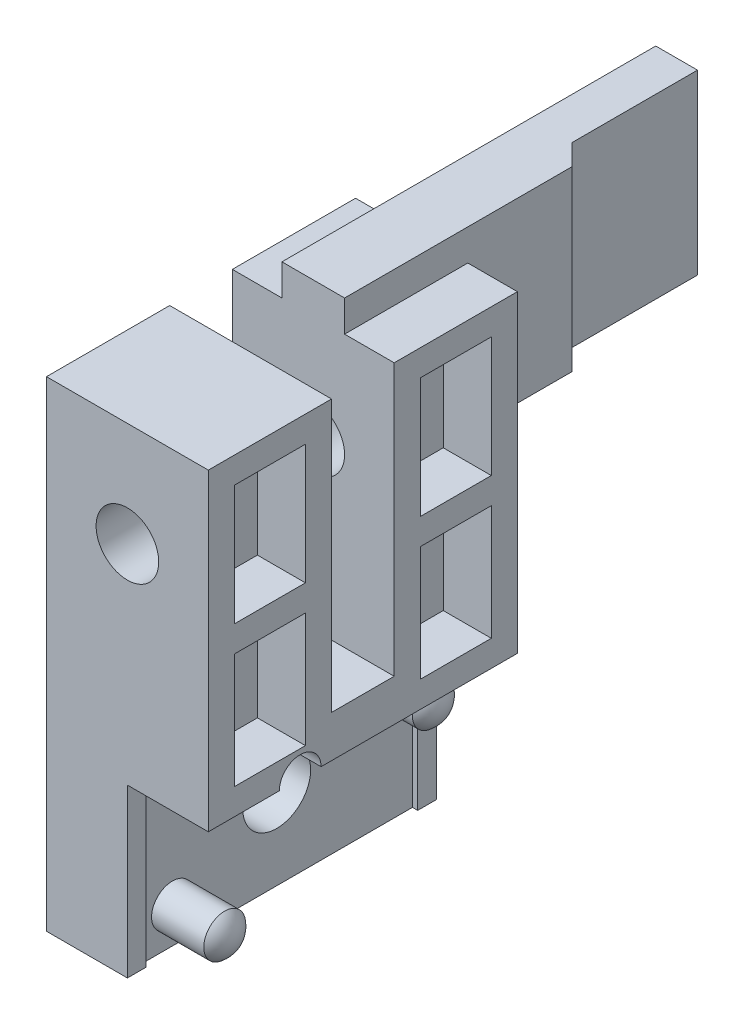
ISO-10303-21;
HEADER;
FILE_DESCRIPTION(('STEP AP214'),'2;1');
FILE_NAME('part.step','',(''),(''),'','','');
FILE_SCHEMA(('AUTOMOTIVE_DESIGN { 1 0 10303 214 1 1 1 1 }'));
ENDSEC;
DATA;
#1=APPLICATION_CONTEXT('core data for automotive mechanical design processes');
#2=APPLICATION_PROTOCOL_DEFINITION('international standard','automotive_design',2000,#1);
#3=PRODUCT_CONTEXT('',#1,'mechanical');
#4=PRODUCT('Part','Part','',(#3));
#5=PRODUCT_RELATED_PRODUCT_CATEGORY('part','',(#4));
#6=PRODUCT_DEFINITION_FORMATION('','',#4);
#7=PRODUCT_DEFINITION_CONTEXT('part definition',#1,'design');
#8=PRODUCT_DEFINITION('design','',#6,#7);
#9=PRODUCT_DEFINITION_SHAPE('','',#8);
#10=(LENGTH_UNIT() NAMED_UNIT(*) SI_UNIT(.MILLI.,.METRE.));
#11=(NAMED_UNIT(*) PLANE_ANGLE_UNIT() SI_UNIT($,.RADIAN.));
#12=(NAMED_UNIT(*) SI_UNIT($,.STERADIAN.) SOLID_ANGLE_UNIT());
#13=UNCERTAINTY_MEASURE_WITH_UNIT(LENGTH_MEASURE(1.E-05),#10,'distance_accuracy_value','');
#14=(GEOMETRIC_REPRESENTATION_CONTEXT(3) GLOBAL_UNCERTAINTY_ASSIGNED_CONTEXT((#13)) GLOBAL_UNIT_ASSIGNED_CONTEXT((#10,
#11,#12)) REPRESENTATION_CONTEXT('',''));
#15=CARTESIAN_POINT('',(0.,0.,0.));
#16=DIRECTION('',(0.,0.,1.));
#17=DIRECTION('',(1.,0.,0.));
#18=AXIS2_PLACEMENT_3D('',#15,#16,#17);
#19=CARTESIAN_POINT('',(-3.875,-14.,0.));
#20=DIRECTION('',(1.,0.,0.));
#21=DIRECTION('',(0.,1.,0.));
#22=AXIS2_PLACEMENT_3D('',#19,#20,#21);
#23=CYLINDRICAL_SURFACE('',#22,1.625);
#24=CARTESIAN_POINT('',(-0.249999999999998,-14.,0.));
#25=DIRECTION('',(1.,0.,0.));
#26=DIRECTION('',(0.,1.,0.));
#27=AXIS2_PLACEMENT_3D('',#24,#25,#26);
#28=CIRCLE('',#27,1.625);
#29=CARTESIAN_POINT('',(-0.249999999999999,-12.375,0.));
#30=VERTEX_POINT('',#29);
#31=EDGE_CURVE('E1105',#30,#30,#28,.T.);
#32=ORIENTED_EDGE('',*,*,#31,.T.);
#33=EDGE_LOOP('',(#32));
#34=FACE_BOUND('',#33,.T.);
#35=CARTESIAN_POINT('',(-1.87499999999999,-14.,0.));
#36=DIRECTION('',(-1.,0.,0.));
#37=DIRECTION('',(0.,-1.,0.));
#38=AXIS2_PLACEMENT_3D('',#35,#36,#37);
#39=CIRCLE('',#38,1.625);
#40=CARTESIAN_POINT('',(-1.87499999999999,-15.625,0.));
#41=VERTEX_POINT('',#40);
#42=EDGE_CURVE('E36',#41,#41,#39,.F.);
#43=ORIENTED_EDGE('',*,*,#42,.F.);
#44=EDGE_LOOP('',(#43));
#45=FACE_BOUND('',#44,.T.);
#46=ADVANCED_FACE('F32',(#34,#45),#23,.F.);
#47=CARTESIAN_POINT('',(3.87500000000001,-10.,7.4));
#48=DIRECTION('',(0.,1.,0.));
#49=DIRECTION('',(-1.,0.,0.));
#50=AXIS2_PLACEMENT_3D('',#47,#48,#49);
#51=PLANE('',#50);
#52=DIRECTION('',(0.,0.,1.));
#53=VECTOR('',#52,1.);
#54=CARTESIAN_POINT('',(-0.249999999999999,-10.,6.5));
#55=LINE('',#54,#53);
#56=CARTESIAN_POINT('',(-0.249999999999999,-10.,4.));
#57=VERTEX_POINT('',#56);
#58=CARTESIAN_POINT('',(-0.249999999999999,-10.,6.5));
#59=VERTEX_POINT('',#58);
#60=EDGE_CURVE('E405',#57,#59,#55,.T.);
#61=ORIENTED_EDGE('',*,*,#60,.F.);
#62=DIRECTION('',(1.,0.,0.));
#63=VECTOR('',#62,1.);
#64=CARTESIAN_POINT('',(-3.07842712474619,-10.,4.));
#65=LINE('',#64,#63);
#66=CARTESIAN_POINT('',(3.87500000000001,-10.,4.));
#67=VERTEX_POINT('',#66);
#68=EDGE_CURVE('E386',#57,#67,#65,.T.);
#69=ORIENTED_EDGE('',*,*,#68,.T.);
#70=DIRECTION('',(0.,0.,-1.));
#71=VECTOR('',#70,1.);
#72=CARTESIAN_POINT('',(3.87500000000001,-10.,7.4));
#73=LINE('',#72,#71);
#74=CARTESIAN_POINT('',(3.87500000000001,-10.,7.4));
#75=VERTEX_POINT('',#74);
#76=EDGE_CURVE('E810',#75,#67,#73,.T.);
#77=ORIENTED_EDGE('',*,*,#76,.F.);
#78=DIRECTION('',(1.,0.,0.));
#79=VECTOR('',#78,1.);
#80=CARTESIAN_POINT('',(3.87500000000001,-10.,7.4));
#81=LINE('',#80,#79);
#82=CARTESIAN_POINT('',(0.,-10.,7.4));
#83=VERTEX_POINT('',#82);
#84=EDGE_CURVE('E796',#83,#75,#81,.T.);
#85=ORIENTED_EDGE('',*,*,#84,.F.);
#86=DIRECTION('',(0.,0.,-1.));
#87=VECTOR('',#86,1.);
#88=CARTESIAN_POINT('',(0.,-10.,7.4));
#89=LINE('',#88,#87);
#90=CARTESIAN_POINT('',(0.,-10.,6.5));
#91=VERTEX_POINT('',#90);
#92=EDGE_CURVE('E814',#83,#91,#89,.T.);
#93=ORIENTED_EDGE('',*,*,#92,.T.);
#94=DIRECTION('',(1.,0.,0.));
#95=VECTOR('',#94,1.);
#96=CARTESIAN_POINT('',(-0.249999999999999,-10.,6.5));
#97=LINE('',#96,#95);
#98=EDGE_CURVE('E417',#59,#91,#97,.T.);
#99=ORIENTED_EDGE('',*,*,#98,.F.);
#100=EDGE_LOOP('',(#61,#69,#77,#85,#93,#99));
#101=FACE_BOUND('',#100,.T.);
#102=ADVANCED_FACE('F847',(#101),#51,.F.);
#103=CARTESIAN_POINT('',(-0.249999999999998,-18.,-6.5));
#104=DIRECTION('',(1.,0.,0.));
#105=DIRECTION('',(0.,1.,0.));
#106=AXIS2_PLACEMENT_3D('',#103,#104,#105);
#107=PLANE('',#106);
#108=CARTESIAN_POINT('',(-0.249999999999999,-10.,-6.5));
#109=VERTEX_POINT('',#108);
#110=CARTESIAN_POINT('',(-0.249999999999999,-10.,2.));
#111=VERTEX_POINT('',#110);
#112=EDGE_CURVE('E395',#109,#111,#55,.T.);
#113=ORIENTED_EDGE('',*,*,#112,.T.);
#114=CARTESIAN_POINT('',(-0.249999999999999,-10.,3.));
#115=DIRECTION('',(1.,0.,0.));
#116=DIRECTION('',(0.,1.,0.));
#117=AXIS2_PLACEMENT_3D('',#114,#115,#116);
#118=CIRCLE('',#117,1.);
#119=EDGE_CURVE('E383',#57,#111,#118,.F.);
#120=ORIENTED_EDGE('',*,*,#119,.F.);
#121=ORIENTED_EDGE('',*,*,#60,.T.);
#122=DIRECTION('',(0.,-1.,0.));
#123=VECTOR('',#122,1.);
#124=CARTESIAN_POINT('',(-0.249999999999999,-10.,6.5));
#125=LINE('',#124,#123);
#126=CARTESIAN_POINT('',(-0.249999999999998,-18.,6.5));
#127=VERTEX_POINT('',#126);
#128=EDGE_CURVE('E404',#59,#127,#125,.T.);
#129=ORIENTED_EDGE('',*,*,#128,.T.);
#130=DIRECTION('',(0.,0.,-1.));
#131=VECTOR('',#130,1.);
#132=CARTESIAN_POINT('',(-0.249999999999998,-18.,-6.5));
#133=LINE('',#132,#131);
#134=CARTESIAN_POINT('',(-0.249999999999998,-18.,-6.5));
#135=VERTEX_POINT('',#134);
#136=EDGE_CURVE('E1109',#127,#135,#133,.T.);
#137=ORIENTED_EDGE('',*,*,#136,.T.);
#138=DIRECTION('',(0.,1.,0.));
#139=VECTOR('',#138,1.);
#140=CARTESIAN_POINT('',(-0.249999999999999,-10.,-6.5));
#141=LINE('',#140,#139);
#142=EDGE_CURVE('E403',#135,#109,#141,.T.);
#143=ORIENTED_EDGE('',*,*,#142,.T.);
#144=EDGE_LOOP('',(#113,#120,#121,#129,#137,#143));
#145=FACE_BOUND('',#144,.T.);
#146=CARTESIAN_POINT('',(-0.249999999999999,-11.6951800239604,-4.99377661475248));
#147=DIRECTION('',(1.,0.,0.));
#148=DIRECTION('',(0.,1.,0.));
#149=AXIS2_PLACEMENT_3D('',#146,#147,#148);
#150=CIRCLE('',#149,1.);
#151=CARTESIAN_POINT('',(-0.249999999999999,-10.6951800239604,-4.99377661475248));
#152=VERTEX_POINT('',#151);
#153=EDGE_CURVE('E1099',#152,#152,#150,.T.);
#154=ORIENTED_EDGE('',*,*,#153,.F.);
#155=EDGE_LOOP('',(#154));
#156=FACE_BOUND('',#155,.T.);
#157=ORIENTED_EDGE('',*,*,#31,.F.);
#158=EDGE_LOOP('',(#157));
#159=FACE_BOUND('',#158,.T.);
#160=CARTESIAN_POINT('',(-0.249999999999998,-16.3048199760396,4.99377661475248));
#161=DIRECTION('',(1.,0.,0.));
#162=DIRECTION('',(0.,-1.,0.));
#163=AXIS2_PLACEMENT_3D('',#160,#161,#162);
#164=CIRCLE('',#163,0.999999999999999);
#165=CARTESIAN_POINT('',(-0.249999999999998,-17.3048199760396,4.99377661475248));
#166=VERTEX_POINT('',#165);
#167=EDGE_CURVE('E1091',#166,#166,#164,.T.);
#168=ORIENTED_EDGE('',*,*,#167,.F.);
#169=EDGE_LOOP('',(#168));
#170=FACE_BOUND('',#169,.T.);
#171=ADVANCED_FACE('F400',(#145,#156,#159,#170),#107,.T.);
#172=CARTESIAN_POINT('',(0.,-10.,7.4));
#173=DIRECTION('',(-1.,0.,0.));
#174=DIRECTION('',(0.,-1.,0.));
#175=AXIS2_PLACEMENT_3D('',#172,#173,#174);
#176=PLANE('',#175);
#177=DIRECTION('',(0.,0.,-1.));
#178=VECTOR('',#177,1.);
#179=CARTESIAN_POINT('',(0.,-18.,7.4));
#180=LINE('',#179,#178);
#181=CARTESIAN_POINT('',(0.,-18.,7.4));
#182=VERTEX_POINT('',#181);
#183=CARTESIAN_POINT('',(0.,-18.,6.5));
#184=VERTEX_POINT('',#183);
#185=EDGE_CURVE('E818',#182,#184,#180,.T.);
#186=ORIENTED_EDGE('',*,*,#185,.T.);
#187=DIRECTION('',(0.,-1.,0.));
#188=VECTOR('',#187,1.);
#189=CARTESIAN_POINT('',(0.,-10.,6.5));
#190=LINE('',#189,#188);
#191=EDGE_CURVE('E1108',#91,#184,#190,.T.);
#192=ORIENTED_EDGE('',*,*,#191,.F.);
#193=ORIENTED_EDGE('',*,*,#92,.F.);
#194=DIRECTION('',(0.,1.,0.));
#195=VECTOR('',#194,1.);
#196=CARTESIAN_POINT('',(0.,-10.,7.4));
#197=LINE('',#196,#195);
#198=EDGE_CURVE('E794',#182,#83,#197,.T.);
#199=ORIENTED_EDGE('',*,*,#198,.F.);
#200=EDGE_LOOP('',(#186,#192,#193,#199));
#201=FACE_BOUND('',#200,.T.);
#202=ADVANCED_FACE('F863',(#201),#176,.F.);
#203=CARTESIAN_POINT('',(-3.87499999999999,5.,7.4));
#204=DIRECTION('',(0.,0.,-1.));
#205=DIRECTION('',(-1.,0.,0.));
#206=AXIS2_PLACEMENT_3D('',#203,#204,#205);
#207=PLANE('',#206);
#208=DIRECTION('',(0.,-1.,0.));
#209=VECTOR('',#208,1.);
#210=CARTESIAN_POINT('',(-3.87499999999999,-18.,7.4));
#211=LINE('',#210,#209);
#212=CARTESIAN_POINT('',(-3.87499999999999,5.,7.4));
#213=VERTEX_POINT('',#212);
#214=CARTESIAN_POINT('',(-3.87499999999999,-18.,7.4));
#215=VERTEX_POINT('',#214);
#216=EDGE_CURVE('E789',#213,#215,#211,.T.);
#217=ORIENTED_EDGE('',*,*,#216,.T.);
#218=DIRECTION('',(1.,0.,0.));
#219=VECTOR('',#218,1.);
#220=CARTESIAN_POINT('',(0.,-18.,7.4));
#221=LINE('',#220,#219);
#222=EDGE_CURVE('E792',#215,#182,#221,.T.);
#223=ORIENTED_EDGE('',*,*,#222,.T.);
#224=ORIENTED_EDGE('',*,*,#198,.T.);
#225=ORIENTED_EDGE('',*,*,#84,.T.);
#226=DIRECTION('',(0.,1.,0.));
#227=VECTOR('',#226,1.);
#228=CARTESIAN_POINT('',(3.87500000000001,5.,7.4));
#229=LINE('',#228,#227);
#230=CARTESIAN_POINT('',(3.87500000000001,5.,7.4));
#231=VERTEX_POINT('',#230);
#232=EDGE_CURVE('E798',#75,#231,#229,.T.);
#233=ORIENTED_EDGE('',*,*,#232,.T.);
#234=DIRECTION('',(-1.,0.,0.));
#235=VECTOR('',#234,1.);
#236=CARTESIAN_POINT('',(-3.87499999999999,5.,7.4));
#237=LINE('',#236,#235);
#238=EDGE_CURVE('E800',#231,#213,#237,.T.);
#239=ORIENTED_EDGE('',*,*,#238,.T.);
#240=EDGE_LOOP('',(#217,#223,#224,#225,#233,#239));
#241=FACE_BOUND('',#240,.T.);
#242=CARTESIAN_POINT('',(0.,0.,7.4));
#243=DIRECTION('',(0.,0.,-1.));
#244=DIRECTION('',(-1.,0.,0.));
#245=AXIS2_PLACEMENT_3D('',#242,#243,#244);
#246=CIRCLE('',#245,1.5);
#247=CARTESIAN_POINT('',(-1.5,0.,7.4));
#248=VERTEX_POINT('',#247);
#249=EDGE_CURVE('E416',#248,#248,#246,.T.);
#250=ORIENTED_EDGE('',*,*,#249,.T.);
#251=EDGE_LOOP('',(#250));
#252=FACE_BOUND('',#251,.T.);
#253=ADVANCED_FACE('F841',(#241,#252),#207,.F.);
#254=CARTESIAN_POINT('',(-3.875,5.,1.5));
#255=DIRECTION('',(0.,0.,1.));
#256=DIRECTION('',(0.,-1.,0.));
#257=AXIS2_PLACEMENT_3D('',#254,#255,#256);
#258=PLANE('',#257);
#259=DIRECTION('',(0.,-1.,0.));
#260=VECTOR('',#259,1.);
#261=CARTESIAN_POINT('',(3.87500000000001,5.,1.5));
#262=LINE('',#261,#260);
#263=CARTESIAN_POINT('',(3.87500000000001,5.,1.5));
#264=VERTEX_POINT('',#263);
#265=CARTESIAN_POINT('',(3.87500000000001,-8.,1.5));
#266=VERTEX_POINT('',#265);
#267=EDGE_CURVE('E750',#264,#266,#262,.T.);
#268=ORIENTED_EDGE('',*,*,#267,.T.);
#269=DIRECTION('',(1.,0.,0.));
#270=VECTOR('',#269,1.);
#271=CARTESIAN_POINT('',(-3.87499999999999,-8.,1.5));
#272=LINE('',#271,#270);
#273=CARTESIAN_POINT('',(-3.87499999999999,-8.,1.5));
#274=VERTEX_POINT('',#273);
#275=EDGE_CURVE('E763',#274,#266,#272,.T.);
#276=ORIENTED_EDGE('',*,*,#275,.F.);
#277=DIRECTION('',(0.,-1.,0.));
#278=VECTOR('',#277,1.);
#279=CARTESIAN_POINT('',(-3.875,5.,1.5));
#280=LINE('',#279,#278);
#281=CARTESIAN_POINT('',(-3.875,5.,1.5));
#282=VERTEX_POINT('',#281);
#283=EDGE_CURVE('E759',#282,#274,#280,.T.);
#284=ORIENTED_EDGE('',*,*,#283,.F.);
#285=DIRECTION('',(1.,0.,0.));
#286=VECTOR('',#285,1.);
#287=CARTESIAN_POINT('',(-3.875,5.,1.5));
#288=LINE('',#287,#286);
#289=EDGE_CURVE('E766',#282,#264,#288,.T.);
#290=ORIENTED_EDGE('',*,*,#289,.T.);
#291=EDGE_LOOP('',(#268,#276,#284,#290));
#292=FACE_BOUND('',#291,.T.);
#293=CARTESIAN_POINT('',(0.,0.,1.5));
#294=DIRECTION('',(0.,0.,1.));
#295=DIRECTION('',(0.,-1.,0.));
#296=AXIS2_PLACEMENT_3D('',#293,#294,#295);
#297=CIRCLE('',#296,1.5);
#298=CARTESIAN_POINT('',(0.,-1.5,1.5));
#299=VERTEX_POINT('',#298);
#300=EDGE_CURVE('E428',#299,#299,#297,.F.);
#301=ORIENTED_EDGE('',*,*,#300,.F.);
#302=EDGE_LOOP('',(#301));
#303=FACE_BOUND('',#302,.T.);
#304=ADVANCED_FACE('F830',(#292,#303),#258,.F.);
#305=CARTESIAN_POINT('',(-3.875,5.,-1.5));
#306=DIRECTION('',(0.,0.,-1.));
#307=DIRECTION('',(0.,1.,0.));
#308=AXIS2_PLACEMENT_3D('',#305,#306,#307);
#309=PLANE('',#308);
#310=DIRECTION('',(1.,0.,0.));
#311=VECTOR('',#310,1.);
#312=CARTESIAN_POINT('',(-3.875,5.,-1.5));
#313=LINE('',#312,#311);
#314=CARTESIAN_POINT('',(1.5,5.,-1.5));
#315=VERTEX_POINT('',#314);
#316=CARTESIAN_POINT('',(3.87500000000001,5.,-1.5));
#317=VERTEX_POINT('',#316);
#318=EDGE_CURVE('E770',#315,#317,#313,.T.);
#319=ORIENTED_EDGE('',*,*,#318,.F.);
#320=DIRECTION('',(0.,1.,0.));
#321=VECTOR('',#320,1.);
#322=CARTESIAN_POINT('',(1.5,-20.1496556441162,-1.5));
#323=LINE('',#322,#321);
#324=CARTESIAN_POINT('',(1.5,6.5,-1.5));
#325=VERTEX_POINT('',#324);
#326=EDGE_CURVE('E456',#315,#325,#323,.T.);
#327=ORIENTED_EDGE('',*,*,#326,.T.);
#328=DIRECTION('',(1.,0.,0.));
#329=VECTOR('',#328,1.);
#330=CARTESIAN_POINT('',(1.5,6.5,-1.5));
#331=LINE('',#330,#329);
#332=CARTESIAN_POINT('',(-1.5,6.5,-1.5));
#333=VERTEX_POINT('',#332);
#334=EDGE_CURVE('E432',#333,#325,#331,.T.);
#335=ORIENTED_EDGE('',*,*,#334,.F.);
#336=DIRECTION('',(0.,1.,0.));
#337=VECTOR('',#336,1.);
#338=CARTESIAN_POINT('',(-1.5,-20.1496556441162,-1.5));
#339=LINE('',#338,#337);
#340=CARTESIAN_POINT('',(-1.5,5.,-1.5));
#341=VERTEX_POINT('',#340);
#342=EDGE_CURVE('E460',#341,#333,#339,.T.);
#343=ORIENTED_EDGE('',*,*,#342,.F.);
#344=CARTESIAN_POINT('',(-3.875,5.,-1.5));
#345=VERTEX_POINT('',#344);
#346=EDGE_CURVE('E768',#345,#341,#313,.T.);
#347=ORIENTED_EDGE('',*,*,#346,.F.);
#348=DIRECTION('',(0.,1.,0.));
#349=VECTOR('',#348,1.);
#350=CARTESIAN_POINT('',(-3.875,5.,-1.5));
#351=LINE('',#350,#349);
#352=CARTESIAN_POINT('',(-3.87499999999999,-8.,-1.5));
#353=VERTEX_POINT('',#352);
#354=EDGE_CURVE('E756',#353,#345,#351,.T.);
#355=ORIENTED_EDGE('',*,*,#354,.F.);
#356=DIRECTION('',(1.,0.,0.));
#357=VECTOR('',#356,1.);
#358=CARTESIAN_POINT('',(-3.87499999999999,-8.,-1.5));
#359=LINE('',#358,#357);
#360=CARTESIAN_POINT('',(3.87500000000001,-8.,-1.5));
#361=VERTEX_POINT('',#360);
#362=EDGE_CURVE('E762',#353,#361,#359,.T.);
#363=ORIENTED_EDGE('',*,*,#362,.T.);
#364=DIRECTION('',(0.,1.,0.));
#365=VECTOR('',#364,1.);
#366=CARTESIAN_POINT('',(3.87500000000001,5.,-1.5));
#367=LINE('',#366,#365);
#368=EDGE_CURVE('E747',#361,#317,#367,.T.);
#369=ORIENTED_EDGE('',*,*,#368,.T.);
#370=EDGE_LOOP('',(#319,#327,#335,#343,#347,#355,#363,#369));
#371=FACE_BOUND('',#370,.T.);
#372=CARTESIAN_POINT('',(0.,0.,-1.5));
#373=DIRECTION('',(0.,0.,-1.));
#374=DIRECTION('',(0.,1.,0.));
#375=AXIS2_PLACEMENT_3D('',#372,#373,#374);
#376=CIRCLE('',#375,1.5);
#377=CARTESIAN_POINT('',(0.,1.5,-1.5));
#378=VERTEX_POINT('',#377);
#379=EDGE_CURVE('E427',#378,#378,#376,.F.);
#380=ORIENTED_EDGE('',*,*,#379,.F.);
#381=EDGE_LOOP('',(#380));
#382=FACE_BOUND('',#381,.T.);
#383=ADVANCED_FACE('F827',(#371,#382),#309,.F.);
#384=CARTESIAN_POINT('',(-3.87499999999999,5.,7.4));
#385=DIRECTION('',(0.,-1.,0.));
#386=DIRECTION('',(1.,0.,0.));
#387=AXIS2_PLACEMENT_3D('',#384,#385,#386);
#388=PLANE('',#387);
#389=ORIENTED_EDGE('',*,*,#346,.T.);
#390=DIRECTION('',(0.,0.,-1.));
#391=VECTOR('',#390,1.);
#392=CARTESIAN_POINT('',(-1.5,5.,7.4));
#393=LINE('',#392,#391);
#394=CARTESIAN_POINT('',(-1.5,5.,-7.4));
#395=VERTEX_POINT('',#394);
#396=EDGE_CURVE('E483',#341,#395,#393,.T.);
#397=ORIENTED_EDGE('',*,*,#396,.T.);
#398=DIRECTION('',(-1.,0.,0.));
#399=VECTOR('',#398,1.);
#400=CARTESIAN_POINT('',(-3.87499999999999,5.,-7.4));
#401=LINE('',#400,#399);
#402=CARTESIAN_POINT('',(-3.87499999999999,5.,-7.4));
#403=VERTEX_POINT('',#402);
#404=EDGE_CURVE('E785',#395,#403,#401,.T.);
#405=ORIENTED_EDGE('',*,*,#404,.T.);
#406=DIRECTION('',(0.,0.,-1.));
#407=VECTOR('',#406,1.);
#408=CARTESIAN_POINT('',(-3.87499999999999,5.,7.4));
#409=LINE('',#408,#407);
#410=EDGE_CURVE('E802',#345,#403,#409,.T.);
#411=ORIENTED_EDGE('',*,*,#410,.F.);
#412=EDGE_LOOP('',(#389,#397,#405,#411));
#413=FACE_BOUND('',#412,.T.);
#414=ADVANCED_FACE('F829',(#413),#388,.F.);
#415=DIRECTION('',(0.,0.,-1.));
#416=VECTOR('',#415,1.);
#417=CARTESIAN_POINT('',(3.87500000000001,5.,7.4));
#418=LINE('',#417,#416);
#419=EDGE_CURVE('E807',#231,#264,#418,.T.);
#420=ORIENTED_EDGE('',*,*,#419,.T.);
#421=ORIENTED_EDGE('',*,*,#289,.F.);
#422=EDGE_CURVE('E803',#213,#282,#409,.T.);
#423=ORIENTED_EDGE('',*,*,#422,.F.);
#424=ORIENTED_EDGE('',*,*,#238,.F.);
#425=EDGE_LOOP('',(#420,#421,#423,#424));
#426=FACE_BOUND('',#425,.T.);
#427=ADVANCED_FACE('F837',(#426),#388,.F.);
#428=CARTESIAN_POINT('',(-3.87499999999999,-18.,7.4));
#429=DIRECTION('',(1.,0.,0.));
#430=DIRECTION('',(0.,1.,0.));
#431=AXIS2_PLACEMENT_3D('',#428,#429,#430);
#432=PLANE('',#431);
#433=CARTESIAN_POINT('',(-3.87499999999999,-14.,0.));
#434=DIRECTION('',(-1.,0.,0.));
#435=DIRECTION('',(0.,-1.,0.));
#436=AXIS2_PLACEMENT_3D('',#433,#434,#435);
#437=CIRCLE('',#436,2.375);
#438=CARTESIAN_POINT('',(-3.87499999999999,-16.375,0.));
#439=VERTEX_POINT('',#438);
#440=EDGE_CURVE('E1215',#439,#439,#437,.T.);
#441=ORIENTED_EDGE('',*,*,#440,.F.);
#442=EDGE_LOOP('',(#441));
#443=FACE_BOUND('',#442,.T.);
#444=DIRECTION('',(0.,0.,1.));
#445=VECTOR('',#444,1.);
#446=CARTESIAN_POINT('',(-3.87499999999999,-12.,-6.15));
#447=LINE('',#446,#445);
#448=CARTESIAN_POINT('',(-3.87499999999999,-12.,-6.14999999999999));
#449=VERTEX_POINT('',#448);
#450=CARTESIAN_POINT('',(-3.87499999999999,-12.,-2.74999999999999));
#451=VERTEX_POINT('',#450);
#452=EDGE_CURVE('E490',#449,#451,#447,.T.);
#453=ORIENTED_EDGE('',*,*,#452,.F.);
#454=DIRECTION('',(0.,-1.,0.));
#455=VECTOR('',#454,1.);
#456=CARTESIAN_POINT('',(-3.87499999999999,-3.25,-6.15));
#457=LINE('',#456,#455);
#458=CARTESIAN_POINT('',(-3.87499999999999,-3.25,-6.15));
#459=VERTEX_POINT('',#458);
#460=EDGE_CURVE('E488',#459,#449,#457,.T.);
#461=ORIENTED_EDGE('',*,*,#460,.F.);
#462=DIRECTION('',(0.,0.,-1.));
#463=VECTOR('',#462,1.);
#464=CARTESIAN_POINT('',(-3.87499999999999,-3.25,-6.15));
#465=LINE('',#464,#463);
#466=CARTESIAN_POINT('',(-3.87499999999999,-3.25,-2.75));
#467=VERTEX_POINT('',#466);
#468=EDGE_CURVE('E496',#467,#459,#465,.T.);
#469=ORIENTED_EDGE('',*,*,#468,.F.);
#470=DIRECTION('',(0.,1.,0.));
#471=VECTOR('',#470,1.);
#472=CARTESIAN_POINT('',(-3.87499999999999,-12.,-2.74999999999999));
#473=LINE('',#472,#471);
#474=EDGE_CURVE('E493',#451,#467,#473,.T.);
#475=ORIENTED_EDGE('',*,*,#474,.F.);
#476=EDGE_LOOP('',(#453,#461,#469,#475));
#477=FACE_BOUND('',#476,.T.);
#478=DIRECTION('',(0.,-1.,0.));
#479=VECTOR('',#478,1.);
#480=CARTESIAN_POINT('',(-3.87499999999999,3.75,-6.15));
#481=LINE('',#480,#479);
#482=CARTESIAN_POINT('',(-3.87499999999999,3.75,-6.15));
#483=VERTEX_POINT('',#482);
#484=CARTESIAN_POINT('',(-3.87499999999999,-2.,-6.15));
#485=VERTEX_POINT('',#484);
#486=EDGE_CURVE('E522',#483,#485,#481,.T.);
#487=ORIENTED_EDGE('',*,*,#486,.F.);
#488=DIRECTION('',(0.,0.,-1.));
#489=VECTOR('',#488,1.);
#490=CARTESIAN_POINT('',(-3.87499999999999,3.75,-2.75));
#491=LINE('',#490,#489);
#492=CARTESIAN_POINT('',(-3.87499999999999,3.75,-2.75));
#493=VERTEX_POINT('',#492);
#494=EDGE_CURVE('E514',#493,#483,#491,.T.);
#495=ORIENTED_EDGE('',*,*,#494,.F.);
#496=DIRECTION('',(0.,1.,0.));
#497=VECTOR('',#496,1.);
#498=CARTESIAN_POINT('',(-3.87499999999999,-2.,-2.75));
#499=LINE('',#498,#497);
#500=CARTESIAN_POINT('',(-3.87499999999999,-2.,-2.75));
#501=VERTEX_POINT('',#500);
#502=EDGE_CURVE('E528',#501,#493,#499,.T.);
#503=ORIENTED_EDGE('',*,*,#502,.F.);
#504=DIRECTION('',(0.,0.,1.));
#505=VECTOR('',#504,1.);
#506=CARTESIAN_POINT('',(-3.87499999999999,-2.,-2.75));
#507=LINE('',#506,#505);
#508=EDGE_CURVE('E525',#485,#501,#507,.T.);
#509=ORIENTED_EDGE('',*,*,#508,.F.);
#510=EDGE_LOOP('',(#487,#495,#503,#509));
#511=FACE_BOUND('',#510,.T.);
#512=DIRECTION('',(0.,0.,1.));
#513=VECTOR('',#512,1.);
#514=CARTESIAN_POINT('',(-3.87499999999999,-2.,6.15));
#515=LINE('',#514,#513);
#516=CARTESIAN_POINT('',(-3.87499999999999,-2.,2.75));
#517=VERTEX_POINT('',#516);
#518=CARTESIAN_POINT('',(-3.87499999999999,-2.,6.15));
#519=VERTEX_POINT('',#518);
#520=EDGE_CURVE('E554',#517,#519,#515,.T.);
#521=ORIENTED_EDGE('',*,*,#520,.F.);
#522=DIRECTION('',(0.,-1.,0.));
#523=VECTOR('',#522,1.);
#524=CARTESIAN_POINT('',(-3.87499999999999,-2.,2.75));
#525=LINE('',#524,#523);
#526=CARTESIAN_POINT('',(-3.87499999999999,3.75,2.75));
#527=VERTEX_POINT('',#526);
#528=EDGE_CURVE('E546',#527,#517,#525,.T.);
#529=ORIENTED_EDGE('',*,*,#528,.F.);
#530=DIRECTION('',(0.,0.,-1.));
#531=VECTOR('',#530,1.);
#532=CARTESIAN_POINT('',(-3.87499999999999,3.75,2.75));
#533=LINE('',#532,#531);
#534=CARTESIAN_POINT('',(-3.87499999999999,3.75,6.15));
#535=VERTEX_POINT('',#534);
#536=EDGE_CURVE('E560',#535,#527,#533,.T.);
#537=ORIENTED_EDGE('',*,*,#536,.F.);
#538=DIRECTION('',(0.,1.,0.));
#539=VECTOR('',#538,1.);
#540=CARTESIAN_POINT('',(-3.87499999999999,3.75,6.15));
#541=LINE('',#540,#539);
#542=EDGE_CURVE('E557',#519,#535,#541,.T.);
#543=ORIENTED_EDGE('',*,*,#542,.F.);
#544=EDGE_LOOP('',(#521,#529,#537,#543));
#545=FACE_BOUND('',#544,.T.);
#546=DIRECTION('',(0.,0.,-1.));
#547=VECTOR('',#546,1.);
#548=CARTESIAN_POINT('',(-3.87499999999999,-3.25,2.75));
#549=LINE('',#548,#547);
#550=CARTESIAN_POINT('',(-3.87499999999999,-3.25,6.15));
#551=VERTEX_POINT('',#550);
#552=CARTESIAN_POINT('',(-3.87499999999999,-3.25,2.75));
#553=VERTEX_POINT('',#552);
#554=EDGE_CURVE('E586',#551,#553,#549,.T.);
#555=ORIENTED_EDGE('',*,*,#554,.F.);
#556=DIRECTION('',(0.,1.,0.));
#557=VECTOR('',#556,1.);
#558=CARTESIAN_POINT('',(-3.87499999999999,-3.25,6.15));
#559=LINE('',#558,#557);
#560=CARTESIAN_POINT('',(-3.87499999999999,-12.,6.15));
#561=VERTEX_POINT('',#560);
#562=EDGE_CURVE('E578',#561,#551,#559,.T.);
#563=ORIENTED_EDGE('',*,*,#562,.F.);
#564=DIRECTION('',(0.,0.,1.));
#565=VECTOR('',#564,1.);
#566=CARTESIAN_POINT('',(-3.87499999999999,-12.,6.15));
#567=LINE('',#566,#565);
#568=CARTESIAN_POINT('',(-3.87499999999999,-12.,2.75));
#569=VERTEX_POINT('',#568);
#570=EDGE_CURVE('E592',#569,#561,#567,.T.);
#571=ORIENTED_EDGE('',*,*,#570,.F.);
#572=DIRECTION('',(0.,-1.,0.));
#573=VECTOR('',#572,1.);
#574=CARTESIAN_POINT('',(-3.87499999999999,-12.,2.75));
#575=LINE('',#574,#573);
#576=EDGE_CURVE('E589',#553,#569,#575,.T.);
#577=ORIENTED_EDGE('',*,*,#576,.F.);
#578=EDGE_LOOP('',(#555,#563,#571,#577));
#579=FACE_BOUND('',#578,.T.);
#580=ORIENTED_EDGE('',*,*,#422,.T.);
#581=ORIENTED_EDGE('',*,*,#283,.T.);
#582=DIRECTION('',(0.,0.,-1.));
#583=VECTOR('',#582,1.);
#584=CARTESIAN_POINT('',(-3.87499999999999,-8.,1.5));
#585=LINE('',#584,#583);
#586=EDGE_CURVE('E753',#274,#353,#585,.T.);
#587=ORIENTED_EDGE('',*,*,#586,.T.);
#588=ORIENTED_EDGE('',*,*,#354,.T.);
#589=ORIENTED_EDGE('',*,*,#410,.T.);
#590=DIRECTION('',(0.,-1.,0.));
#591=VECTOR('',#590,1.);
#592=CARTESIAN_POINT('',(-3.87499999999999,-18.,-7.4));
#593=LINE('',#592,#591);
#594=CARTESIAN_POINT('',(-3.87499999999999,-18.,-7.4));
#595=VERTEX_POINT('',#594);
#596=EDGE_CURVE('E765',#403,#595,#593,.T.);
#597=ORIENTED_EDGE('',*,*,#596,.T.);
#598=DIRECTION('',(0.,0.,-1.));
#599=VECTOR('',#598,1.);
#600=CARTESIAN_POINT('',(-3.87499999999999,-18.,7.4));
#601=LINE('',#600,#599);
#602=EDGE_CURVE('E41',#215,#595,#601,.T.);
#603=ORIENTED_EDGE('',*,*,#602,.F.);
#604=ORIENTED_EDGE('',*,*,#216,.F.);
#605=EDGE_LOOP('',(#580,#581,#587,#588,#589,#597,#603,#604));
#606=FACE_BOUND('',#605,.T.);
#607=ADVANCED_FACE('F1151',(#443,#477,#511,#545,#579,#606),#432,.F.);
#608=CARTESIAN_POINT('',(0.,-18.,7.4));
#609=DIRECTION('',(0.,1.,0.));
#610=DIRECTION('',(-1.,0.,0.));
#611=AXIS2_PLACEMENT_3D('',#608,#609,#610);
#612=PLANE('',#611);
#613=ORIENTED_EDGE('',*,*,#136,.F.);
#614=DIRECTION('',(1.,0.,0.));
#615=VECTOR('',#614,1.);
#616=CARTESIAN_POINT('',(-0.249999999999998,-18.,6.5));
#617=LINE('',#616,#615);
#618=EDGE_CURVE('E413',#127,#184,#617,.T.);
#619=ORIENTED_EDGE('',*,*,#618,.T.);
#620=ORIENTED_EDGE('',*,*,#185,.F.);
#621=ORIENTED_EDGE('',*,*,#222,.F.);
#622=ORIENTED_EDGE('',*,*,#602,.T.);
#623=DIRECTION('',(1.,0.,0.));
#624=VECTOR('',#623,1.);
#625=CARTESIAN_POINT('',(0.,-18.,-7.4));
#626=LINE('',#625,#624);
#627=CARTESIAN_POINT('',(0.,-18.,-7.4));
#628=VERTEX_POINT('',#627);
#629=EDGE_CURVE('E774',#595,#628,#626,.T.);
#630=ORIENTED_EDGE('',*,*,#629,.T.);
#631=CARTESIAN_POINT('',(0.,-18.,-6.5));
#632=VERTEX_POINT('',#631);
#633=EDGE_CURVE('E817',#632,#628,#180,.T.);
#634=ORIENTED_EDGE('',*,*,#633,.F.);
#635=DIRECTION('',(1.,0.,0.));
#636=VECTOR('',#635,1.);
#637=CARTESIAN_POINT('',(-0.249999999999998,-18.,-6.5));
#638=LINE('',#637,#636);
#639=EDGE_CURVE('E408',#135,#632,#638,.T.);
#640=ORIENTED_EDGE('',*,*,#639,.F.);
#641=EDGE_LOOP('',(#613,#619,#620,#621,#622,#630,#634,#640));
#642=FACE_BOUND('',#641,.T.);
#643=ADVANCED_FACE('F1115',(#642),#612,.F.);
#644=CARTESIAN_POINT('',(0.,-10.,-6.5));
#645=VERTEX_POINT('',#644);
#646=CARTESIAN_POINT('',(0.,-10.,-7.4));
#647=VERTEX_POINT('',#646);
#648=EDGE_CURVE('E813',#645,#647,#89,.T.);
#649=ORIENTED_EDGE('',*,*,#648,.F.);
#650=DIRECTION('',(0.,1.,0.));
#651=VECTOR('',#650,1.);
#652=CARTESIAN_POINT('',(0.,-10.,-6.5));
#653=LINE('',#652,#651);
#654=EDGE_CURVE('E55',#632,#645,#653,.T.);
#655=ORIENTED_EDGE('',*,*,#654,.F.);
#656=ORIENTED_EDGE('',*,*,#633,.T.);
#657=DIRECTION('',(0.,1.,0.));
#658=VECTOR('',#657,1.);
#659=CARTESIAN_POINT('',(0.,-10.,-7.4));
#660=LINE('',#659,#658);
#661=EDGE_CURVE('E777',#628,#647,#660,.T.);
#662=ORIENTED_EDGE('',*,*,#661,.T.);
#663=EDGE_LOOP('',(#649,#655,#656,#662));
#664=FACE_BOUND('',#663,.T.);
#665=ADVANCED_FACE('F1118',(#664),#176,.F.);
#666=CARTESIAN_POINT('',(3.87500000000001,-10.,2.));
#667=VERTEX_POINT('',#666);
#668=CARTESIAN_POINT('',(3.87500000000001,-10.,-7.4));
#669=VERTEX_POINT('',#668);
#670=EDGE_CURVE('E398',#667,#669,#73,.T.);
#671=ORIENTED_EDGE('',*,*,#670,.F.);
#672=DIRECTION('',(1.,0.,0.));
#673=VECTOR('',#672,1.);
#674=CARTESIAN_POINT('',(-3.07842712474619,-10.,2.));
#675=LINE('',#674,#673);
#676=EDGE_CURVE('E48',#667,#111,#675,.F.);
#677=ORIENTED_EDGE('',*,*,#676,.T.);
#678=ORIENTED_EDGE('',*,*,#112,.F.);
#679=DIRECTION('',(1.,0.,0.));
#680=VECTOR('',#679,1.);
#681=CARTESIAN_POINT('',(-0.249999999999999,-10.,-6.5));
#682=LINE('',#681,#680);
#683=EDGE_CURVE('E419',#109,#645,#682,.T.);
#684=ORIENTED_EDGE('',*,*,#683,.T.);
#685=ORIENTED_EDGE('',*,*,#648,.T.);
#686=DIRECTION('',(1.,0.,0.));
#687=VECTOR('',#686,1.);
#688=CARTESIAN_POINT('',(3.87500000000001,-10.,-7.4));
#689=LINE('',#688,#687);
#690=EDGE_CURVE('E780',#647,#669,#689,.T.);
#691=ORIENTED_EDGE('',*,*,#690,.T.);
#692=EDGE_LOOP('',(#671,#677,#678,#684,#685,#691));
#693=FACE_BOUND('',#692,.T.);
#694=ADVANCED_FACE('F394',(#693),#51,.F.);
#695=CARTESIAN_POINT('',(3.87500000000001,5.,7.4));
#696=DIRECTION('',(-1.,0.,0.));
#697=DIRECTION('',(0.,-1.,0.));
#698=AXIS2_PLACEMENT_3D('',#695,#696,#697);
#699=PLANE('',#698);
#700=DIRECTION('',(0.,-1.,0.));
#701=VECTOR('',#700,1.);
#702=CARTESIAN_POINT('',(3.87500000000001,-2.,-2.75));
#703=LINE('',#702,#701);
#704=CARTESIAN_POINT('',(3.87500000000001,3.75,-2.75));
#705=VERTEX_POINT('',#704);
#706=CARTESIAN_POINT('',(3.87500000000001,-2.,-2.75));
#707=VERTEX_POINT('',#706);
#708=EDGE_CURVE('E618',#705,#707,#703,.T.);
#709=ORIENTED_EDGE('',*,*,#708,.F.);
#710=DIRECTION('',(0.,0.,1.));
#711=VECTOR('',#710,1.);
#712=CARTESIAN_POINT('',(3.87500000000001,3.75,-2.75));
#713=LINE('',#712,#711);
#714=CARTESIAN_POINT('',(3.87500000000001,3.75,-6.15));
#715=VERTEX_POINT('',#714);
#716=EDGE_CURVE('E610',#715,#705,#713,.T.);
#717=ORIENTED_EDGE('',*,*,#716,.F.);
#718=DIRECTION('',(0.,1.,0.));
#719=VECTOR('',#718,1.);
#720=CARTESIAN_POINT('',(3.87500000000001,3.75,-6.15));
#721=LINE('',#720,#719);
#722=CARTESIAN_POINT('',(3.87500000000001,-2.,-6.15));
#723=VERTEX_POINT('',#722);
#724=EDGE_CURVE('E624',#723,#715,#721,.T.);
#725=ORIENTED_EDGE('',*,*,#724,.F.);
#726=DIRECTION('',(0.,0.,-1.));
#727=VECTOR('',#726,1.);
#728=CARTESIAN_POINT('',(3.87500000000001,-2.,-6.15));
#729=LINE('',#728,#727);
#730=EDGE_CURVE('E621',#707,#723,#729,.T.);
#731=ORIENTED_EDGE('',*,*,#730,.F.);
#732=EDGE_LOOP('',(#709,#717,#725,#731));
#733=FACE_BOUND('',#732,.T.);
#734=DIRECTION('',(0.,1.,0.));
#735=VECTOR('',#734,1.);
#736=CARTESIAN_POINT('',(3.87500000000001,-3.25,-6.15));
#737=LINE('',#736,#735);
#738=CARTESIAN_POINT('',(3.87500000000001,-8.75,-6.15));
#739=VERTEX_POINT('',#738);
#740=CARTESIAN_POINT('',(3.87500000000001,-3.25,-6.15));
#741=VERTEX_POINT('',#740);
#742=EDGE_CURVE('E650',#739,#741,#737,.T.);
#743=ORIENTED_EDGE('',*,*,#742,.F.);
#744=DIRECTION('',(0.,0.,-1.));
#745=VECTOR('',#744,1.);
#746=CARTESIAN_POINT('',(3.87500000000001,-8.75,-6.15));
#747=LINE('',#746,#745);
#748=CARTESIAN_POINT('',(3.87500000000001,-8.75,-2.75));
#749=VERTEX_POINT('',#748);
#750=EDGE_CURVE('E642',#749,#739,#747,.T.);
#751=ORIENTED_EDGE('',*,*,#750,.F.);
#752=DIRECTION('',(0.,-1.,0.));
#753=VECTOR('',#752,1.);
#754=CARTESIAN_POINT('',(3.87500000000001,-8.75,-2.75));
#755=LINE('',#754,#753);
#756=CARTESIAN_POINT('',(3.87500000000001,-3.25,-2.75));
#757=VERTEX_POINT('',#756);
#758=EDGE_CURVE('E656',#757,#749,#755,.T.);
#759=ORIENTED_EDGE('',*,*,#758,.F.);
#760=DIRECTION('',(0.,0.,1.));
#761=VECTOR('',#760,1.);
#762=CARTESIAN_POINT('',(3.87500000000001,-3.25,-6.15));
#763=LINE('',#762,#761);
#764=EDGE_CURVE('E653',#741,#757,#763,.T.);
#765=ORIENTED_EDGE('',*,*,#764,.F.);
#766=EDGE_LOOP('',(#743,#751,#759,#765));
#767=FACE_BOUND('',#766,.T.);
#768=DIRECTION('',(0.,-1.,0.));
#769=VECTOR('',#768,1.);
#770=CARTESIAN_POINT('',(3.87500000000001,3.75,6.15));
#771=LINE('',#770,#769);
#772=CARTESIAN_POINT('',(3.87500000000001,3.75,6.15));
#773=VERTEX_POINT('',#772);
#774=CARTESIAN_POINT('',(3.87500000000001,-2.,6.15));
#775=VERTEX_POINT('',#774);
#776=EDGE_CURVE('E682',#773,#775,#771,.T.);
#777=ORIENTED_EDGE('',*,*,#776,.F.);
#778=DIRECTION('',(0.,0.,1.));
#779=VECTOR('',#778,1.);
#780=CARTESIAN_POINT('',(3.87500000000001,3.75,2.75));
#781=LINE('',#780,#779);
#782=CARTESIAN_POINT('',(3.87500000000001,3.75,2.75));
#783=VERTEX_POINT('',#782);
#784=EDGE_CURVE('E674',#783,#773,#781,.T.);
#785=ORIENTED_EDGE('',*,*,#784,.F.);
#786=DIRECTION('',(0.,1.,0.));
#787=VECTOR('',#786,1.);
#788=CARTESIAN_POINT('',(3.87500000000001,-2.,2.75));
#789=LINE('',#788,#787);
#790=CARTESIAN_POINT('',(3.87500000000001,-2.,2.75));
#791=VERTEX_POINT('',#790);
#792=EDGE_CURVE('E688',#791,#783,#789,.T.);
#793=ORIENTED_EDGE('',*,*,#792,.F.);
#794=DIRECTION('',(0.,0.,-1.));
#795=VECTOR('',#794,1.);
#796=CARTESIAN_POINT('',(3.87500000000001,-2.,6.15));
#797=LINE('',#796,#795);
#798=EDGE_CURVE('E685',#775,#791,#797,.T.);
#799=ORIENTED_EDGE('',*,*,#798,.F.);
#800=EDGE_LOOP('',(#777,#785,#793,#799));
#801=FACE_BOUND('',#800,.T.);
#802=DIRECTION('',(0.,1.,0.));
#803=VECTOR('',#802,1.);
#804=CARTESIAN_POINT('',(3.87500000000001,-8.75,2.75));
#805=LINE('',#804,#803);
#806=CARTESIAN_POINT('',(3.87500000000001,-8.75,2.75));
#807=VERTEX_POINT('',#806);
#808=CARTESIAN_POINT('',(3.87500000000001,-3.25,2.75));
#809=VERTEX_POINT('',#808);
#810=EDGE_CURVE('E714',#807,#809,#805,.T.);
#811=ORIENTED_EDGE('',*,*,#810,.F.);
#812=DIRECTION('',(0.,0.,-1.));
#813=VECTOR('',#812,1.);
#814=CARTESIAN_POINT('',(3.87500000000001,-8.75,6.15));
#815=LINE('',#814,#813);
#816=CARTESIAN_POINT('',(3.87500000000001,-8.75,6.15));
#817=VERTEX_POINT('',#816);
#818=EDGE_CURVE('E706',#817,#807,#815,.T.);
#819=ORIENTED_EDGE('',*,*,#818,.F.);
#820=DIRECTION('',(0.,-1.,0.));
#821=VECTOR('',#820,1.);
#822=CARTESIAN_POINT('',(3.87500000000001,-3.25,6.15));
#823=LINE('',#822,#821);
#824=CARTESIAN_POINT('',(3.87500000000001,-3.25,6.15));
#825=VERTEX_POINT('',#824);
#826=EDGE_CURVE('E720',#825,#817,#823,.T.);
#827=ORIENTED_EDGE('',*,*,#826,.F.);
#828=DIRECTION('',(0.,0.,1.));
#829=VECTOR('',#828,1.);
#830=CARTESIAN_POINT('',(3.87500000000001,-3.25,6.15));
#831=LINE('',#830,#829);
#832=EDGE_CURVE('E717',#809,#825,#831,.T.);
#833=ORIENTED_EDGE('',*,*,#832,.F.);
#834=EDGE_LOOP('',(#811,#819,#827,#833));
#835=FACE_BOUND('',#834,.T.);
#836=ORIENTED_EDGE('',*,*,#76,.T.);
#837=CARTESIAN_POINT('',(3.87500000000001,-10.,3.));
#838=DIRECTION('',(-1.,0.,0.));
#839=DIRECTION('',(0.,-1.,0.));
#840=AXIS2_PLACEMENT_3D('',#837,#838,#839);
#841=CIRCLE('',#840,1.);
#842=EDGE_CURVE('E11',#67,#667,#841,.T.);
#843=ORIENTED_EDGE('',*,*,#842,.T.);
#844=ORIENTED_EDGE('',*,*,#670,.T.);
#845=DIRECTION('',(0.,1.,0.));
#846=VECTOR('',#845,1.);
#847=CARTESIAN_POINT('',(3.87500000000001,5.,-7.4));
#848=LINE('',#847,#846);
#849=CARTESIAN_POINT('',(3.87500000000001,5.,-7.4));
#850=VERTEX_POINT('',#849);
#851=EDGE_CURVE('E782',#669,#850,#848,.T.);
#852=ORIENTED_EDGE('',*,*,#851,.T.);
#853=EDGE_CURVE('E806',#317,#850,#418,.T.);
#854=ORIENTED_EDGE('',*,*,#853,.F.);
#855=ORIENTED_EDGE('',*,*,#368,.F.);
#856=DIRECTION('',(0.,0.,-1.));
#857=VECTOR('',#856,1.);
#858=CARTESIAN_POINT('',(3.87500000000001,-8.,1.5));
#859=LINE('',#858,#857);
#860=EDGE_CURVE('E738',#266,#361,#859,.T.);
#861=ORIENTED_EDGE('',*,*,#860,.F.);
#862=ORIENTED_EDGE('',*,*,#267,.F.);
#863=ORIENTED_EDGE('',*,*,#419,.F.);
#864=ORIENTED_EDGE('',*,*,#232,.F.);
#865=EDGE_LOOP('',(#836,#843,#844,#852,#854,#855,#861,#862,#863,#864));
#866=FACE_BOUND('',#865,.T.);
#867=ADVANCED_FACE('F1079',(#733,#767,#801,#835,#866),#699,.F.);
#868=CARTESIAN_POINT('',(1.5,5.,-7.4));
#869=VERTEX_POINT('',#868);
#870=EDGE_CURVE('E786',#850,#869,#401,.T.);
#871=ORIENTED_EDGE('',*,*,#870,.T.);
#872=DIRECTION('',(0.,0.,1.));
#873=VECTOR('',#872,1.);
#874=CARTESIAN_POINT('',(1.5,5.,7.4));
#875=LINE('',#874,#873);
#876=EDGE_CURVE('E478',#869,#315,#875,.T.);
#877=ORIENTED_EDGE('',*,*,#876,.T.);
#878=ORIENTED_EDGE('',*,*,#318,.T.);
#879=ORIENTED_EDGE('',*,*,#853,.T.);
#880=EDGE_LOOP('',(#871,#877,#878,#879));
#881=FACE_BOUND('',#880,.T.);
#882=ADVANCED_FACE('F840',(#881),#388,.F.);
#883=CARTESIAN_POINT('',(-3.87499999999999,5.,-7.4));
#884=DIRECTION('',(0.,0.,-1.));
#885=DIRECTION('',(-1.,0.,0.));
#886=AXIS2_PLACEMENT_3D('',#883,#884,#885);
#887=PLANE('',#886);
#888=DIRECTION('',(0.,1.,0.));
#889=VECTOR('',#888,1.);
#890=CARTESIAN_POINT('',(-1.5,5.,-7.4));
#891=LINE('',#890,#889);
#892=CARTESIAN_POINT('',(-1.5,-2.,-7.4));
#893=VERTEX_POINT('',#892);
#894=EDGE_CURVE('E480',#893,#395,#891,.T.);
#895=ORIENTED_EDGE('',*,*,#894,.F.);
#896=DIRECTION('',(-1.,0.,0.));
#897=VECTOR('',#896,1.);
#898=CARTESIAN_POINT('',(-3.87499999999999,-2.,-7.4));
#899=LINE('',#898,#897);
#900=CARTESIAN_POINT('',(1.5,-2.,-7.4));
#901=VERTEX_POINT('',#900);
#902=EDGE_CURVE('E485',#901,#893,#899,.T.);
#903=ORIENTED_EDGE('',*,*,#902,.F.);
#904=DIRECTION('',(0.,-1.,0.));
#905=VECTOR('',#904,1.);
#906=CARTESIAN_POINT('',(1.5,5.,-7.4));
#907=LINE('',#906,#905);
#908=EDGE_CURVE('E475',#869,#901,#907,.T.);
#909=ORIENTED_EDGE('',*,*,#908,.F.);
#910=ORIENTED_EDGE('',*,*,#870,.F.);
#911=ORIENTED_EDGE('',*,*,#851,.F.);
#912=ORIENTED_EDGE('',*,*,#690,.F.);
#913=ORIENTED_EDGE('',*,*,#661,.F.);
#914=ORIENTED_EDGE('',*,*,#629,.F.);
#915=ORIENTED_EDGE('',*,*,#596,.F.);
#916=ORIENTED_EDGE('',*,*,#404,.F.);
#917=EDGE_LOOP('',(#895,#903,#909,#910,#911,#912,#913,#914,#915,#916));
#918=FACE_BOUND('',#917,.T.);
#919=ADVANCED_FACE('F1070',(#918),#887,.T.);
#920=CARTESIAN_POINT('',(-3.87499999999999,-8.,1.5));
#921=DIRECTION('',(0.,-1.,0.));
#922=DIRECTION('',(1.,0.,0.));
#923=AXIS2_PLACEMENT_3D('',#920,#921,#922);
#924=PLANE('',#923);
#925=ORIENTED_EDGE('',*,*,#860,.T.);
#926=ORIENTED_EDGE('',*,*,#362,.F.);
#927=ORIENTED_EDGE('',*,*,#586,.F.);
#928=ORIENTED_EDGE('',*,*,#275,.T.);
#929=EDGE_LOOP('',(#925,#926,#927,#928));
#930=FACE_BOUND('',#929,.T.);
#931=ADVANCED_FACE('F1065',(#930),#924,.F.);
#932=CARTESIAN_POINT('',(1.57500000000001,-8.75,6.15));
#933=DIRECTION('',(0.,-1.,0.));
#934=DIRECTION('',(0.,0.,-1.));
#935=AXIS2_PLACEMENT_3D('',#932,#933,#934);
#936=PLANE('',#935);
#937=ORIENTED_EDGE('',*,*,#818,.T.);
#938=DIRECTION('',(1.,0.,0.));
#939=VECTOR('',#938,1.);
#940=CARTESIAN_POINT('',(1.57500000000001,-8.75,2.75));
#941=LINE('',#940,#939);
#942=CARTESIAN_POINT('',(1.57500000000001,-8.75,2.75));
#943=VERTEX_POINT('',#942);
#944=EDGE_CURVE('E735',#943,#807,#941,.T.);
#945=ORIENTED_EDGE('',*,*,#944,.F.);
#946=DIRECTION('',(0.,0.,-1.));
#947=VECTOR('',#946,1.);
#948=CARTESIAN_POINT('',(1.57500000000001,-8.75,6.15));
#949=LINE('',#948,#947);
#950=CARTESIAN_POINT('',(1.57500000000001,-8.75,6.15));
#951=VERTEX_POINT('',#950);
#952=EDGE_CURVE('E723',#951,#943,#949,.T.);
#953=ORIENTED_EDGE('',*,*,#952,.F.);
#954=DIRECTION('',(1.,0.,0.));
#955=VECTOR('',#954,1.);
#956=CARTESIAN_POINT('',(1.57500000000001,-8.75,6.15));
#957=LINE('',#956,#955);
#958=EDGE_CURVE('E736',#951,#817,#957,.T.);
#959=ORIENTED_EDGE('',*,*,#958,.T.);
#960=EDGE_LOOP('',(#937,#945,#953,#959));
#961=FACE_BOUND('',#960,.T.);
#962=ADVANCED_FACE('F1056',(#961),#936,.F.);
#963=CARTESIAN_POINT('',(1.57500000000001,-3.25,6.15));
#964=DIRECTION('',(0.,0.,1.));
#965=DIRECTION('',(1.,0.,0.));
#966=AXIS2_PLACEMENT_3D('',#963,#964,#965);
#967=PLANE('',#966);
#968=ORIENTED_EDGE('',*,*,#826,.T.);
#969=ORIENTED_EDGE('',*,*,#958,.F.);
#970=DIRECTION('',(0.,-1.,0.));
#971=VECTOR('',#970,1.);
#972=CARTESIAN_POINT('',(1.57500000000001,-3.25,6.15));
#973=LINE('',#972,#971);
#974=CARTESIAN_POINT('',(1.57500000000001,-3.25,6.15));
#975=VERTEX_POINT('',#974);
#976=EDGE_CURVE('E732',#975,#951,#973,.T.);
#977=ORIENTED_EDGE('',*,*,#976,.F.);
#978=DIRECTION('',(1.,0.,0.));
#979=VECTOR('',#978,1.);
#980=CARTESIAN_POINT('',(1.57500000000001,-3.25,6.15));
#981=LINE('',#980,#979);
#982=EDGE_CURVE('E739',#975,#825,#981,.T.);
#983=ORIENTED_EDGE('',*,*,#982,.T.);
#984=EDGE_LOOP('',(#968,#969,#977,#983));
#985=FACE_BOUND('',#984,.T.);
#986=ADVANCED_FACE('F1052',(#985),#967,.F.);
#987=CARTESIAN_POINT('',(1.57500000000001,-3.25,6.15));
#988=DIRECTION('',(0.,1.,0.));
#989=DIRECTION('',(-1.,0.,0.));
#990=AXIS2_PLACEMENT_3D('',#987,#988,#989);
#991=PLANE('',#990);
#992=ORIENTED_EDGE('',*,*,#832,.T.);
#993=ORIENTED_EDGE('',*,*,#982,.F.);
#994=DIRECTION('',(0.,0.,1.));
#995=VECTOR('',#994,1.);
#996=CARTESIAN_POINT('',(1.57500000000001,-3.25,6.15));
#997=LINE('',#996,#995);
#998=CARTESIAN_POINT('',(1.57500000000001,-3.25,2.75));
#999=VERTEX_POINT('',#998);
#1000=EDGE_CURVE('E729',#999,#975,#997,.T.);
#1001=ORIENTED_EDGE('',*,*,#1000,.F.);
#1002=DIRECTION('',(1.,0.,0.));
#1003=VECTOR('',#1002,1.);
#1004=CARTESIAN_POINT('',(1.57500000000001,-3.25,2.75));
#1005=LINE('',#1004,#1003);
#1006=EDGE_CURVE('E741',#999,#809,#1005,.T.);
#1007=ORIENTED_EDGE('',*,*,#1006,.T.);
#1008=EDGE_LOOP('',(#992,#993,#1001,#1007));
#1009=FACE_BOUND('',#1008,.T.);
#1010=ADVANCED_FACE('F1055',(#1009),#991,.F.);
#1011=CARTESIAN_POINT('',(1.57500000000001,-8.75,2.75));
#1012=DIRECTION('',(0.,0.,-1.));
#1013=DIRECTION('',(0.,1.,0.));
#1014=AXIS2_PLACEMENT_3D('',#1011,#1012,#1013);
#1015=PLANE('',#1014);
#1016=ORIENTED_EDGE('',*,*,#810,.T.);
#1017=ORIENTED_EDGE('',*,*,#1006,.F.);
#1018=DIRECTION('',(0.,1.,0.));
#1019=VECTOR('',#1018,1.);
#1020=CARTESIAN_POINT('',(1.57500000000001,-8.75,2.75));
#1021=LINE('',#1020,#1019);
#1022=EDGE_CURVE('E726',#943,#999,#1021,.T.);
#1023=ORIENTED_EDGE('',*,*,#1022,.F.);
#1024=ORIENTED_EDGE('',*,*,#944,.T.);
#1025=EDGE_LOOP('',(#1016,#1017,#1023,#1024));
#1026=FACE_BOUND('',#1025,.T.);
#1027=ADVANCED_FACE('F1050',(#1026),#1015,.F.);
#1028=CARTESIAN_POINT('',(1.57500000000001,-8.75,6.15));
#1029=DIRECTION('',(-1.,0.,0.));
#1030=DIRECTION('',(0.,-1.,0.));
#1031=AXIS2_PLACEMENT_3D('',#1028,#1029,#1030);
#1032=PLANE('',#1031);
#1033=ORIENTED_EDGE('',*,*,#952,.T.);
#1034=ORIENTED_EDGE('',*,*,#1022,.T.);
#1035=ORIENTED_EDGE('',*,*,#1000,.T.);
#1036=ORIENTED_EDGE('',*,*,#976,.T.);
#1037=EDGE_LOOP('',(#1033,#1034,#1035,#1036));
#1038=FACE_BOUND('',#1037,.T.);
#1039=ADVANCED_FACE('F1046',(#1038),#1032,.F.);
#1040=CARTESIAN_POINT('',(1.57500000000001,3.75,2.75));
#1041=DIRECTION('',(0.,1.,0.));
#1042=DIRECTION('',(0.,0.,1.));
#1043=AXIS2_PLACEMENT_3D('',#1040,#1041,#1042);
#1044=PLANE('',#1043);
#1045=ORIENTED_EDGE('',*,*,#784,.T.);
#1046=DIRECTION('',(1.,0.,0.));
#1047=VECTOR('',#1046,1.);
#1048=CARTESIAN_POINT('',(1.57500000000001,3.75,6.15));
#1049=LINE('',#1048,#1047);
#1050=CARTESIAN_POINT('',(1.57500000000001,3.75,6.15));
#1051=VERTEX_POINT('',#1050);
#1052=EDGE_CURVE('E703',#1051,#773,#1049,.T.);
#1053=ORIENTED_EDGE('',*,*,#1052,.F.);
#1054=DIRECTION('',(0.,0.,1.));
#1055=VECTOR('',#1054,1.);
#1056=CARTESIAN_POINT('',(1.57500000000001,3.75,2.75));
#1057=LINE('',#1056,#1055);
#1058=CARTESIAN_POINT('',(1.57500000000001,3.75,2.75));
#1059=VERTEX_POINT('',#1058);
#1060=EDGE_CURVE('E691',#1059,#1051,#1057,.T.);
#1061=ORIENTED_EDGE('',*,*,#1060,.F.);
#1062=DIRECTION('',(1.,0.,0.));
#1063=VECTOR('',#1062,1.);
#1064=CARTESIAN_POINT('',(1.57500000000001,3.75,2.75));
#1065=LINE('',#1064,#1063);
#1066=EDGE_CURVE('E704',#1059,#783,#1065,.T.);
#1067=ORIENTED_EDGE('',*,*,#1066,.T.);
#1068=EDGE_LOOP('',(#1045,#1053,#1061,#1067));
#1069=FACE_BOUND('',#1068,.T.);
#1070=ADVANCED_FACE('F1036',(#1069),#1044,.F.);
#1071=CARTESIAN_POINT('',(1.57500000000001,-2.,2.75));
#1072=DIRECTION('',(0.,0.,-1.));
#1073=DIRECTION('',(0.,1.,0.));
#1074=AXIS2_PLACEMENT_3D('',#1071,#1072,#1073);
#1075=PLANE('',#1074);
#1076=ORIENTED_EDGE('',*,*,#792,.T.);
#1077=ORIENTED_EDGE('',*,*,#1066,.F.);
#1078=DIRECTION('',(0.,1.,0.));
#1079=VECTOR('',#1078,1.);
#1080=CARTESIAN_POINT('',(1.57500000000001,-2.,2.75));
#1081=LINE('',#1080,#1079);
#1082=CARTESIAN_POINT('',(1.57500000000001,-2.,2.75));
#1083=VERTEX_POINT('',#1082);
#1084=EDGE_CURVE('E700',#1083,#1059,#1081,.T.);
#1085=ORIENTED_EDGE('',*,*,#1084,.F.);
#1086=DIRECTION('',(1.,0.,0.));
#1087=VECTOR('',#1086,1.);
#1088=CARTESIAN_POINT('',(1.57500000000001,-2.,2.75));
#1089=LINE('',#1088,#1087);
#1090=EDGE_CURVE('E707',#1083,#791,#1089,.T.);
#1091=ORIENTED_EDGE('',*,*,#1090,.T.);
#1092=EDGE_LOOP('',(#1076,#1077,#1085,#1091));
#1093=FACE_BOUND('',#1092,.T.);
#1094=ADVANCED_FACE('F1032',(#1093),#1075,.F.);
#1095=CARTESIAN_POINT('',(1.57500000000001,-2.,6.15));
#1096=DIRECTION('',(0.,-1.,0.));
#1097=DIRECTION('',(1.,0.,0.));
#1098=AXIS2_PLACEMENT_3D('',#1095,#1096,#1097);
#1099=PLANE('',#1098);
#1100=ORIENTED_EDGE('',*,*,#798,.T.);
#1101=ORIENTED_EDGE('',*,*,#1090,.F.);
#1102=DIRECTION('',(0.,0.,-1.));
#1103=VECTOR('',#1102,1.);
#1104=CARTESIAN_POINT('',(1.57500000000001,-2.,6.15));
#1105=LINE('',#1104,#1103);
#1106=CARTESIAN_POINT('',(1.57500000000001,-2.,6.15));
#1107=VERTEX_POINT('',#1106);
#1108=EDGE_CURVE('E697',#1107,#1083,#1105,.T.);
#1109=ORIENTED_EDGE('',*,*,#1108,.F.);
#1110=DIRECTION('',(1.,0.,0.));
#1111=VECTOR('',#1110,1.);
#1112=CARTESIAN_POINT('',(1.57500000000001,-2.,6.15));
#1113=LINE('',#1112,#1111);
#1114=EDGE_CURVE('E709',#1107,#775,#1113,.T.);
#1115=ORIENTED_EDGE('',*,*,#1114,.T.);
#1116=EDGE_LOOP('',(#1100,#1101,#1109,#1115));
#1117=FACE_BOUND('',#1116,.T.);
#1118=ADVANCED_FACE('F1035',(#1117),#1099,.F.);
#1119=CARTESIAN_POINT('',(1.57500000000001,3.75,6.15));
#1120=DIRECTION('',(0.,0.,1.));
#1121=DIRECTION('',(1.,0.,0.));
#1122=AXIS2_PLACEMENT_3D('',#1119,#1120,#1121);
#1123=PLANE('',#1122);
#1124=ORIENTED_EDGE('',*,*,#776,.T.);
#1125=ORIENTED_EDGE('',*,*,#1114,.F.);
#1126=DIRECTION('',(0.,-1.,0.));
#1127=VECTOR('',#1126,1.);
#1128=CARTESIAN_POINT('',(1.57500000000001,3.75,6.15));
#1129=LINE('',#1128,#1127);
#1130=EDGE_CURVE('E694',#1051,#1107,#1129,.T.);
#1131=ORIENTED_EDGE('',*,*,#1130,.F.);
#1132=ORIENTED_EDGE('',*,*,#1052,.T.);
#1133=EDGE_LOOP('',(#1124,#1125,#1131,#1132));
#1134=FACE_BOUND('',#1133,.T.);
#1135=ADVANCED_FACE('F1030',(#1134),#1123,.F.);
#1136=CARTESIAN_POINT('',(1.57500000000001,3.75,2.75));
#1137=DIRECTION('',(-1.,0.,0.));
#1138=DIRECTION('',(0.,-1.,0.));
#1139=AXIS2_PLACEMENT_3D('',#1136,#1137,#1138);
#1140=PLANE('',#1139);
#1141=ORIENTED_EDGE('',*,*,#1060,.T.);
#1142=ORIENTED_EDGE('',*,*,#1130,.T.);
#1143=ORIENTED_EDGE('',*,*,#1108,.T.);
#1144=ORIENTED_EDGE('',*,*,#1084,.T.);
#1145=EDGE_LOOP('',(#1141,#1142,#1143,#1144));
#1146=FACE_BOUND('',#1145,.T.);
#1147=ADVANCED_FACE('F1026',(#1146),#1140,.F.);
#1148=CARTESIAN_POINT('',(1.57500000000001,-8.75,-6.15));
#1149=DIRECTION('',(0.,-1.,0.));
#1150=DIRECTION('',(0.,0.,-1.));
#1151=AXIS2_PLACEMENT_3D('',#1148,#1149,#1150);
#1152=PLANE('',#1151);
#1153=ORIENTED_EDGE('',*,*,#750,.T.);
#1154=DIRECTION('',(1.,0.,0.));
#1155=VECTOR('',#1154,1.);
#1156=CARTESIAN_POINT('',(1.57500000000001,-8.75,-6.15));
#1157=LINE('',#1156,#1155);
#1158=CARTESIAN_POINT('',(1.57500000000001,-8.75,-6.15));
#1159=VERTEX_POINT('',#1158);
#1160=EDGE_CURVE('E671',#1159,#739,#1157,.T.);
#1161=ORIENTED_EDGE('',*,*,#1160,.F.);
#1162=DIRECTION('',(0.,0.,-1.));
#1163=VECTOR('',#1162,1.);
#1164=CARTESIAN_POINT('',(1.57500000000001,-8.75,-6.15));
#1165=LINE('',#1164,#1163);
#1166=CARTESIAN_POINT('',(1.57500000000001,-8.75,-2.75));
#1167=VERTEX_POINT('',#1166);
#1168=EDGE_CURVE('E659',#1167,#1159,#1165,.T.);
#1169=ORIENTED_EDGE('',*,*,#1168,.F.);
#1170=DIRECTION('',(1.,0.,0.));
#1171=VECTOR('',#1170,1.);
#1172=CARTESIAN_POINT('',(1.57500000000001,-8.75,-2.75));
#1173=LINE('',#1172,#1171);
#1174=EDGE_CURVE('E672',#1167,#749,#1173,.T.);
#1175=ORIENTED_EDGE('',*,*,#1174,.T.);
#1176=EDGE_LOOP('',(#1153,#1161,#1169,#1175));
#1177=FACE_BOUND('',#1176,.T.);
#1178=ADVANCED_FACE('F1016',(#1177),#1152,.F.);
#1179=CARTESIAN_POINT('',(1.57500000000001,-8.75,-2.75));
#1180=DIRECTION('',(0.,0.,1.));
#1181=DIRECTION('',(0.,-1.,0.));
#1182=AXIS2_PLACEMENT_3D('',#1179,#1180,#1181);
#1183=PLANE('',#1182);
#1184=ORIENTED_EDGE('',*,*,#758,.T.);
#1185=ORIENTED_EDGE('',*,*,#1174,.F.);
#1186=DIRECTION('',(0.,-1.,0.));
#1187=VECTOR('',#1186,1.);
#1188=CARTESIAN_POINT('',(1.57500000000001,-8.75,-2.75));
#1189=LINE('',#1188,#1187);
#1190=CARTESIAN_POINT('',(1.57500000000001,-3.25,-2.75));
#1191=VERTEX_POINT('',#1190);
#1192=EDGE_CURVE('E668',#1191,#1167,#1189,.T.);
#1193=ORIENTED_EDGE('',*,*,#1192,.F.);
#1194=DIRECTION('',(1.,0.,0.));
#1195=VECTOR('',#1194,1.);
#1196=CARTESIAN_POINT('',(1.57500000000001,-3.25,-2.75));
#1197=LINE('',#1196,#1195);
#1198=EDGE_CURVE('E675',#1191,#757,#1197,.T.);
#1199=ORIENTED_EDGE('',*,*,#1198,.T.);
#1200=EDGE_LOOP('',(#1184,#1185,#1193,#1199));
#1201=FACE_BOUND('',#1200,.T.);
#1202=ADVANCED_FACE('F1012',(#1201),#1183,.F.);
#1203=CARTESIAN_POINT('',(1.57500000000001,-3.25,-6.15));
#1204=DIRECTION('',(0.,1.,0.));
#1205=DIRECTION('',(-1.,0.,0.));
#1206=AXIS2_PLACEMENT_3D('',#1203,#1204,#1205);
#1207=PLANE('',#1206);
#1208=ORIENTED_EDGE('',*,*,#764,.T.);
#1209=ORIENTED_EDGE('',*,*,#1198,.F.);
#1210=DIRECTION('',(0.,0.,1.));
#1211=VECTOR('',#1210,1.);
#1212=CARTESIAN_POINT('',(1.57500000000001,-3.25,-6.15));
#1213=LINE('',#1212,#1211);
#1214=CARTESIAN_POINT('',(1.57500000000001,-3.25,-6.15));
#1215=VERTEX_POINT('',#1214);
#1216=EDGE_CURVE('E665',#1215,#1191,#1213,.T.);
#1217=ORIENTED_EDGE('',*,*,#1216,.F.);
#1218=DIRECTION('',(1.,0.,0.));
#1219=VECTOR('',#1218,1.);
#1220=CARTESIAN_POINT('',(1.57500000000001,-3.25,-6.15));
#1221=LINE('',#1220,#1219);
#1222=EDGE_CURVE('E677',#1215,#741,#1221,.T.);
#1223=ORIENTED_EDGE('',*,*,#1222,.T.);
#1224=EDGE_LOOP('',(#1208,#1209,#1217,#1223));
#1225=FACE_BOUND('',#1224,.T.);
#1226=ADVANCED_FACE('F1015',(#1225),#1207,.F.);
#1227=CARTESIAN_POINT('',(1.57500000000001,-3.25,-6.15));
#1228=DIRECTION('',(0.,0.,-1.));
#1229=DIRECTION('',(0.,1.,0.));
#1230=AXIS2_PLACEMENT_3D('',#1227,#1228,#1229);
#1231=PLANE('',#1230);
#1232=ORIENTED_EDGE('',*,*,#742,.T.);
#1233=ORIENTED_EDGE('',*,*,#1222,.F.);
#1234=DIRECTION('',(0.,1.,0.));
#1235=VECTOR('',#1234,1.);
#1236=CARTESIAN_POINT('',(1.57500000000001,-3.25,-6.15));
#1237=LINE('',#1236,#1235);
#1238=EDGE_CURVE('E662',#1159,#1215,#1237,.T.);
#1239=ORIENTED_EDGE('',*,*,#1238,.F.);
#1240=ORIENTED_EDGE('',*,*,#1160,.T.);
#1241=EDGE_LOOP('',(#1232,#1233,#1239,#1240));
#1242=FACE_BOUND('',#1241,.T.);
#1243=ADVANCED_FACE('F1010',(#1242),#1231,.F.);
#1244=CARTESIAN_POINT('',(1.57500000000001,-8.75,-6.15));
#1245=DIRECTION('',(1.,0.,0.));
#1246=DIRECTION('',(0.,1.,0.));
#1247=AXIS2_PLACEMENT_3D('',#1244,#1245,#1246);
#1248=PLANE('',#1247);
#1249=ORIENTED_EDGE('',*,*,#1168,.T.);
#1250=ORIENTED_EDGE('',*,*,#1238,.T.);
#1251=ORIENTED_EDGE('',*,*,#1216,.T.);
#1252=ORIENTED_EDGE('',*,*,#1192,.T.);
#1253=EDGE_LOOP('',(#1249,#1250,#1251,#1252));
#1254=FACE_BOUND('',#1253,.T.);
#1255=ADVANCED_FACE('F1006',(#1254),#1248,.T.);
#1256=CARTESIAN_POINT('',(1.57500000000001,3.75,-2.75));
#1257=DIRECTION('',(0.,1.,0.));
#1258=DIRECTION('',(0.,0.,1.));
#1259=AXIS2_PLACEMENT_3D('',#1256,#1257,#1258);
#1260=PLANE('',#1259);
#1261=ORIENTED_EDGE('',*,*,#716,.T.);
#1262=DIRECTION('',(1.,0.,0.));
#1263=VECTOR('',#1262,1.);
#1264=CARTESIAN_POINT('',(1.57500000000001,3.75,-2.75));
#1265=LINE('',#1264,#1263);
#1266=CARTESIAN_POINT('',(1.57500000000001,3.75,-2.75));
#1267=VERTEX_POINT('',#1266);
#1268=EDGE_CURVE('E639',#1267,#705,#1265,.T.);
#1269=ORIENTED_EDGE('',*,*,#1268,.F.);
#1270=DIRECTION('',(0.,0.,1.));
#1271=VECTOR('',#1270,1.);
#1272=CARTESIAN_POINT('',(1.57500000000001,3.75,-2.75));
#1273=LINE('',#1272,#1271);
#1274=CARTESIAN_POINT('',(1.57500000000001,3.75,-6.15));
#1275=VERTEX_POINT('',#1274);
#1276=EDGE_CURVE('E627',#1275,#1267,#1273,.T.);
#1277=ORIENTED_EDGE('',*,*,#1276,.F.);
#1278=DIRECTION('',(1.,0.,0.));
#1279=VECTOR('',#1278,1.);
#1280=CARTESIAN_POINT('',(1.57500000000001,3.75,-6.15));
#1281=LINE('',#1280,#1279);
#1282=EDGE_CURVE('E640',#1275,#715,#1281,.T.);
#1283=ORIENTED_EDGE('',*,*,#1282,.T.);
#1284=EDGE_LOOP('',(#1261,#1269,#1277,#1283));
#1285=FACE_BOUND('',#1284,.T.);
#1286=ADVANCED_FACE('F996',(#1285),#1260,.F.);
#1287=CARTESIAN_POINT('',(1.57500000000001,3.75,-6.15));
#1288=DIRECTION('',(0.,0.,-1.));
#1289=DIRECTION('',(-1.,0.,0.));
#1290=AXIS2_PLACEMENT_3D('',#1287,#1288,#1289);
#1291=PLANE('',#1290);
#1292=ORIENTED_EDGE('',*,*,#724,.T.);
#1293=ORIENTED_EDGE('',*,*,#1282,.F.);
#1294=DIRECTION('',(0.,1.,0.));
#1295=VECTOR('',#1294,1.);
#1296=CARTESIAN_POINT('',(1.57500000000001,3.75,-6.15));
#1297=LINE('',#1296,#1295);
#1298=CARTESIAN_POINT('',(1.57500000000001,-2.,-6.15));
#1299=VERTEX_POINT('',#1298);
#1300=EDGE_CURVE('E636',#1299,#1275,#1297,.T.);
#1301=ORIENTED_EDGE('',*,*,#1300,.F.);
#1302=DIRECTION('',(1.,0.,0.));
#1303=VECTOR('',#1302,1.);
#1304=CARTESIAN_POINT('',(1.57500000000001,-2.,-6.15));
#1305=LINE('',#1304,#1303);
#1306=EDGE_CURVE('E643',#1299,#723,#1305,.T.);
#1307=ORIENTED_EDGE('',*,*,#1306,.T.);
#1308=EDGE_LOOP('',(#1292,#1293,#1301,#1307));
#1309=FACE_BOUND('',#1308,.T.);
#1310=ADVANCED_FACE('F992',(#1309),#1291,.F.);
#1311=CARTESIAN_POINT('',(1.57500000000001,-2.,-6.15));
#1312=DIRECTION('',(0.,-1.,0.));
#1313=DIRECTION('',(1.,0.,0.));
#1314=AXIS2_PLACEMENT_3D('',#1311,#1312,#1313);
#1315=PLANE('',#1314);
#1316=ORIENTED_EDGE('',*,*,#730,.T.);
#1317=ORIENTED_EDGE('',*,*,#1306,.F.);
#1318=DIRECTION('',(0.,0.,-1.));
#1319=VECTOR('',#1318,1.);
#1320=CARTESIAN_POINT('',(1.57500000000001,-2.,-6.15));
#1321=LINE('',#1320,#1319);
#1322=CARTESIAN_POINT('',(1.57500000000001,-2.,-2.75));
#1323=VERTEX_POINT('',#1322);
#1324=EDGE_CURVE('E633',#1323,#1299,#1321,.T.);
#1325=ORIENTED_EDGE('',*,*,#1324,.F.);
#1326=DIRECTION('',(1.,0.,0.));
#1327=VECTOR('',#1326,1.);
#1328=CARTESIAN_POINT('',(1.57500000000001,-2.,-2.75));
#1329=LINE('',#1328,#1327);
#1330=EDGE_CURVE('E645',#1323,#707,#1329,.T.);
#1331=ORIENTED_EDGE('',*,*,#1330,.T.);
#1332=EDGE_LOOP('',(#1316,#1317,#1325,#1331));
#1333=FACE_BOUND('',#1332,.T.);
#1334=ADVANCED_FACE('F995',(#1333),#1315,.F.);
#1335=CARTESIAN_POINT('',(1.57500000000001,-2.,-2.75));
#1336=DIRECTION('',(0.,0.,1.));
#1337=DIRECTION('',(0.,-1.,0.));
#1338=AXIS2_PLACEMENT_3D('',#1335,#1336,#1337);
#1339=PLANE('',#1338);
#1340=ORIENTED_EDGE('',*,*,#708,.T.);
#1341=ORIENTED_EDGE('',*,*,#1330,.F.);
#1342=DIRECTION('',(0.,-1.,0.));
#1343=VECTOR('',#1342,1.);
#1344=CARTESIAN_POINT('',(1.57500000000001,-2.,-2.75));
#1345=LINE('',#1344,#1343);
#1346=EDGE_CURVE('E630',#1267,#1323,#1345,.T.);
#1347=ORIENTED_EDGE('',*,*,#1346,.F.);
#1348=ORIENTED_EDGE('',*,*,#1268,.T.);
#1349=EDGE_LOOP('',(#1340,#1341,#1347,#1348));
#1350=FACE_BOUND('',#1349,.T.);
#1351=ADVANCED_FACE('F990',(#1350),#1339,.F.);
#1352=CARTESIAN_POINT('',(1.57500000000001,3.75,-6.15));
#1353=DIRECTION('',(-1.,0.,0.));
#1354=DIRECTION('',(0.,-1.,0.));
#1355=AXIS2_PLACEMENT_3D('',#1352,#1353,#1354);
#1356=PLANE('',#1355);
#1357=ORIENTED_EDGE('',*,*,#1276,.T.);
#1358=ORIENTED_EDGE('',*,*,#1346,.T.);
#1359=ORIENTED_EDGE('',*,*,#1324,.T.);
#1360=ORIENTED_EDGE('',*,*,#1300,.T.);
#1361=EDGE_LOOP('',(#1357,#1358,#1359,#1360));
#1362=FACE_BOUND('',#1361,.T.);
#1363=ADVANCED_FACE('F986',(#1362),#1356,.F.);
#1364=CARTESIAN_POINT('',(-1.57499999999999,-3.25,6.15));
#1365=DIRECTION('',(0.,0.,1.));
#1366=DIRECTION('',(0.,-1.,0.));
#1367=AXIS2_PLACEMENT_3D('',#1364,#1365,#1366);
#1368=PLANE('',#1367);
#1369=ORIENTED_EDGE('',*,*,#562,.T.);
#1370=DIRECTION('',(-1.,0.,0.));
#1371=VECTOR('',#1370,1.);
#1372=CARTESIAN_POINT('',(-1.57499999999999,-3.25,6.15));
#1373=LINE('',#1372,#1371);
#1374=CARTESIAN_POINT('',(-1.57499999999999,-3.25,6.15));
#1375=VERTEX_POINT('',#1374);
#1376=EDGE_CURVE('E607',#1375,#551,#1373,.T.);
#1377=ORIENTED_EDGE('',*,*,#1376,.F.);
#1378=DIRECTION('',(0.,1.,0.));
#1379=VECTOR('',#1378,1.);
#1380=CARTESIAN_POINT('',(-1.57499999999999,-3.25,6.15));
#1381=LINE('',#1380,#1379);
#1382=CARTESIAN_POINT('',(-1.57499999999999,-12.,6.15));
#1383=VERTEX_POINT('',#1382);
#1384=EDGE_CURVE('E595',#1383,#1375,#1381,.T.);
#1385=ORIENTED_EDGE('',*,*,#1384,.F.);
#1386=DIRECTION('',(-1.,0.,0.));
#1387=VECTOR('',#1386,1.);
#1388=CARTESIAN_POINT('',(-1.57499999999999,-12.,6.15));
#1389=LINE('',#1388,#1387);
#1390=EDGE_CURVE('E608',#1383,#561,#1389,.T.);
#1391=ORIENTED_EDGE('',*,*,#1390,.T.);
#1392=EDGE_LOOP('',(#1369,#1377,#1385,#1391));
#1393=FACE_BOUND('',#1392,.T.);
#1394=ADVANCED_FACE('F976',(#1393),#1368,.F.);
#1395=CARTESIAN_POINT('',(-1.57499999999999,-12.,6.15));
#1396=DIRECTION('',(0.,-1.,0.));
#1397=DIRECTION('',(1.,0.,0.));
#1398=AXIS2_PLACEMENT_3D('',#1395,#1396,#1397);
#1399=PLANE('',#1398);
#1400=ORIENTED_EDGE('',*,*,#570,.T.);
#1401=ORIENTED_EDGE('',*,*,#1390,.F.);
#1402=DIRECTION('',(0.,0.,1.));
#1403=VECTOR('',#1402,1.);
#1404=CARTESIAN_POINT('',(-1.57499999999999,-12.,6.15));
#1405=LINE('',#1404,#1403);
#1406=CARTESIAN_POINT('',(-1.57499999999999,-12.,2.75));
#1407=VERTEX_POINT('',#1406);
#1408=EDGE_CURVE('E604',#1407,#1383,#1405,.T.);
#1409=ORIENTED_EDGE('',*,*,#1408,.F.);
#1410=DIRECTION('',(-1.,0.,0.));
#1411=VECTOR('',#1410,1.);
#1412=CARTESIAN_POINT('',(-1.57499999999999,-12.,2.75));
#1413=LINE('',#1412,#1411);
#1414=EDGE_CURVE('E611',#1407,#569,#1413,.T.);
#1415=ORIENTED_EDGE('',*,*,#1414,.T.);
#1416=EDGE_LOOP('',(#1400,#1401,#1409,#1415));
#1417=FACE_BOUND('',#1416,.T.);
#1418=ADVANCED_FACE('F972',(#1417),#1399,.F.);
#1419=CARTESIAN_POINT('',(-1.57499999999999,-12.,2.75));
#1420=DIRECTION('',(0.,0.,-1.));
#1421=DIRECTION('',(0.,1.,0.));
#1422=AXIS2_PLACEMENT_3D('',#1419,#1420,#1421);
#1423=PLANE('',#1422);
#1424=ORIENTED_EDGE('',*,*,#576,.T.);
#1425=ORIENTED_EDGE('',*,*,#1414,.F.);
#1426=DIRECTION('',(0.,-1.,0.));
#1427=VECTOR('',#1426,1.);
#1428=CARTESIAN_POINT('',(-1.57499999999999,-12.,2.75));
#1429=LINE('',#1428,#1427);
#1430=CARTESIAN_POINT('',(-1.57499999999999,-3.25,2.75));
#1431=VERTEX_POINT('',#1430);
#1432=EDGE_CURVE('E601',#1431,#1407,#1429,.T.);
#1433=ORIENTED_EDGE('',*,*,#1432,.F.);
#1434=DIRECTION('',(-1.,0.,0.));
#1435=VECTOR('',#1434,1.);
#1436=CARTESIAN_POINT('',(-1.57499999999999,-3.25,2.75));
#1437=LINE('',#1436,#1435);
#1438=EDGE_CURVE('E613',#1431,#553,#1437,.T.);
#1439=ORIENTED_EDGE('',*,*,#1438,.T.);
#1440=EDGE_LOOP('',(#1424,#1425,#1433,#1439));
#1441=FACE_BOUND('',#1440,.T.);
#1442=ADVANCED_FACE('F975',(#1441),#1423,.F.);
#1443=CARTESIAN_POINT('',(-1.57499999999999,-3.25,2.75));
#1444=DIRECTION('',(0.,1.,0.));
#1445=DIRECTION('',(-1.,0.,0.));
#1446=AXIS2_PLACEMENT_3D('',#1443,#1444,#1445);
#1447=PLANE('',#1446);
#1448=ORIENTED_EDGE('',*,*,#554,.T.);
#1449=ORIENTED_EDGE('',*,*,#1438,.F.);
#1450=DIRECTION('',(0.,0.,-1.));
#1451=VECTOR('',#1450,1.);
#1452=CARTESIAN_POINT('',(-1.57499999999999,-3.25,2.75));
#1453=LINE('',#1452,#1451);
#1454=EDGE_CURVE('E598',#1375,#1431,#1453,.T.);
#1455=ORIENTED_EDGE('',*,*,#1454,.F.);
#1456=ORIENTED_EDGE('',*,*,#1376,.T.);
#1457=EDGE_LOOP('',(#1448,#1449,#1455,#1456));
#1458=FACE_BOUND('',#1457,.T.);
#1459=ADVANCED_FACE('F970',(#1458),#1447,.F.);
#1460=CARTESIAN_POINT('',(-1.57499999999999,-12.,6.15));
#1461=DIRECTION('',(1.,0.,0.));
#1462=DIRECTION('',(0.,1.,0.));
#1463=AXIS2_PLACEMENT_3D('',#1460,#1461,#1462);
#1464=PLANE('',#1463);
#1465=ORIENTED_EDGE('',*,*,#1384,.T.);
#1466=ORIENTED_EDGE('',*,*,#1454,.T.);
#1467=ORIENTED_EDGE('',*,*,#1432,.T.);
#1468=ORIENTED_EDGE('',*,*,#1408,.T.);
#1469=EDGE_LOOP('',(#1465,#1466,#1467,#1468));
#1470=FACE_BOUND('',#1469,.T.);
#1471=ADVANCED_FACE('F966',(#1470),#1464,.F.);
#1472=CARTESIAN_POINT('',(-1.57499999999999,-2.,2.75));
#1473=DIRECTION('',(0.,0.,-1.));
#1474=DIRECTION('',(0.,1.,0.));
#1475=AXIS2_PLACEMENT_3D('',#1472,#1473,#1474);
#1476=PLANE('',#1475);
#1477=ORIENTED_EDGE('',*,*,#528,.T.);
#1478=DIRECTION('',(-1.,0.,0.));
#1479=VECTOR('',#1478,1.);
#1480=CARTESIAN_POINT('',(-1.57499999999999,-2.,2.75));
#1481=LINE('',#1480,#1479);
#1482=CARTESIAN_POINT('',(-1.57499999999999,-2.,2.75));
#1483=VERTEX_POINT('',#1482);
#1484=EDGE_CURVE('E575',#1483,#517,#1481,.T.);
#1485=ORIENTED_EDGE('',*,*,#1484,.F.);
#1486=DIRECTION('',(0.,-1.,0.));
#1487=VECTOR('',#1486,1.);
#1488=CARTESIAN_POINT('',(-1.57499999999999,-2.,2.75));
#1489=LINE('',#1488,#1487);
#1490=CARTESIAN_POINT('',(-1.57499999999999,3.75,2.75));
#1491=VERTEX_POINT('',#1490);
#1492=EDGE_CURVE('E563',#1491,#1483,#1489,.T.);
#1493=ORIENTED_EDGE('',*,*,#1492,.F.);
#1494=DIRECTION('',(-1.,0.,0.));
#1495=VECTOR('',#1494,1.);
#1496=CARTESIAN_POINT('',(-1.57499999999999,3.75,2.75));
#1497=LINE('',#1496,#1495);
#1498=EDGE_CURVE('E576',#1491,#527,#1497,.T.);
#1499=ORIENTED_EDGE('',*,*,#1498,.T.);
#1500=EDGE_LOOP('',(#1477,#1485,#1493,#1499));
#1501=FACE_BOUND('',#1500,.T.);
#1502=ADVANCED_FACE('F956',(#1501),#1476,.F.);
#1503=CARTESIAN_POINT('',(-1.57499999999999,3.75,2.75));
#1504=DIRECTION('',(0.,1.,0.));
#1505=DIRECTION('',(0.,0.,1.));
#1506=AXIS2_PLACEMENT_3D('',#1503,#1504,#1505);
#1507=PLANE('',#1506);
#1508=ORIENTED_EDGE('',*,*,#536,.T.);
#1509=ORIENTED_EDGE('',*,*,#1498,.F.);
#1510=DIRECTION('',(0.,0.,-1.));
#1511=VECTOR('',#1510,1.);
#1512=CARTESIAN_POINT('',(-1.57499999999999,3.75,2.75));
#1513=LINE('',#1512,#1511);
#1514=CARTESIAN_POINT('',(-1.57499999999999,3.75,6.15));
#1515=VERTEX_POINT('',#1514);
#1516=EDGE_CURVE('E572',#1515,#1491,#1513,.T.);
#1517=ORIENTED_EDGE('',*,*,#1516,.F.);
#1518=DIRECTION('',(-1.,0.,0.));
#1519=VECTOR('',#1518,1.);
#1520=CARTESIAN_POINT('',(-1.57499999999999,3.75,6.15));
#1521=LINE('',#1520,#1519);
#1522=EDGE_CURVE('E579',#1515,#535,#1521,.T.);
#1523=ORIENTED_EDGE('',*,*,#1522,.T.);
#1524=EDGE_LOOP('',(#1508,#1509,#1517,#1523));
#1525=FACE_BOUND('',#1524,.T.);
#1526=ADVANCED_FACE('F952',(#1525),#1507,.F.);
#1527=CARTESIAN_POINT('',(-1.57499999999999,3.75,6.15));
#1528=DIRECTION('',(0.,0.,1.));
#1529=DIRECTION('',(0.,-1.,0.));
#1530=AXIS2_PLACEMENT_3D('',#1527,#1528,#1529);
#1531=PLANE('',#1530);
#1532=ORIENTED_EDGE('',*,*,#542,.T.);
#1533=ORIENTED_EDGE('',*,*,#1522,.F.);
#1534=DIRECTION('',(0.,1.,0.));
#1535=VECTOR('',#1534,1.);
#1536=CARTESIAN_POINT('',(-1.57499999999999,3.75,6.15));
#1537=LINE('',#1536,#1535);
#1538=CARTESIAN_POINT('',(-1.57499999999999,-2.,6.15));
#1539=VERTEX_POINT('',#1538);
#1540=EDGE_CURVE('E569',#1539,#1515,#1537,.T.);
#1541=ORIENTED_EDGE('',*,*,#1540,.F.);
#1542=DIRECTION('',(-1.,0.,0.));
#1543=VECTOR('',#1542,1.);
#1544=CARTESIAN_POINT('',(-1.57499999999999,-2.,6.15));
#1545=LINE('',#1544,#1543);
#1546=EDGE_CURVE('E581',#1539,#519,#1545,.T.);
#1547=ORIENTED_EDGE('',*,*,#1546,.T.);
#1548=EDGE_LOOP('',(#1532,#1533,#1541,#1547));
#1549=FACE_BOUND('',#1548,.T.);
#1550=ADVANCED_FACE('F955',(#1549),#1531,.F.);
#1551=CARTESIAN_POINT('',(-1.57499999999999,-2.,6.15));
#1552=DIRECTION('',(0.,-1.,0.));
#1553=DIRECTION('',(1.,0.,0.));
#1554=AXIS2_PLACEMENT_3D('',#1551,#1552,#1553);
#1555=PLANE('',#1554);
#1556=ORIENTED_EDGE('',*,*,#520,.T.);
#1557=ORIENTED_EDGE('',*,*,#1546,.F.);
#1558=DIRECTION('',(0.,0.,1.));
#1559=VECTOR('',#1558,1.);
#1560=CARTESIAN_POINT('',(-1.57499999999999,-2.,6.15));
#1561=LINE('',#1560,#1559);
#1562=EDGE_CURVE('E566',#1483,#1539,#1561,.T.);
#1563=ORIENTED_EDGE('',*,*,#1562,.F.);
#1564=ORIENTED_EDGE('',*,*,#1484,.T.);
#1565=EDGE_LOOP('',(#1556,#1557,#1563,#1564));
#1566=FACE_BOUND('',#1565,.T.);
#1567=ADVANCED_FACE('F950',(#1566),#1555,.F.);
#1568=CARTESIAN_POINT('',(-1.57499999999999,-2.,2.75));
#1569=DIRECTION('',(-1.,0.,0.));
#1570=DIRECTION('',(0.,-1.,0.));
#1571=AXIS2_PLACEMENT_3D('',#1568,#1569,#1570);
#1572=PLANE('',#1571);
#1573=ORIENTED_EDGE('',*,*,#1492,.T.);
#1574=ORIENTED_EDGE('',*,*,#1562,.T.);
#1575=ORIENTED_EDGE('',*,*,#1540,.T.);
#1576=ORIENTED_EDGE('',*,*,#1516,.T.);
#1577=EDGE_LOOP('',(#1573,#1574,#1575,#1576));
#1578=FACE_BOUND('',#1577,.T.);
#1579=ADVANCED_FACE('F946',(#1578),#1572,.T.);
#1580=CARTESIAN_POINT('',(-1.57499999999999,3.75,-2.75));
#1581=DIRECTION('',(0.,1.,0.));
#1582=DIRECTION('',(0.,0.,1.));
#1583=AXIS2_PLACEMENT_3D('',#1580,#1581,#1582);
#1584=PLANE('',#1583);
#1585=ORIENTED_EDGE('',*,*,#494,.T.);
#1586=DIRECTION('',(-1.,0.,0.));
#1587=VECTOR('',#1586,1.);
#1588=CARTESIAN_POINT('',(-1.57499999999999,3.75,-6.15));
#1589=LINE('',#1588,#1587);
#1590=CARTESIAN_POINT('',(-1.57499999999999,3.75,-6.15));
#1591=VERTEX_POINT('',#1590);
#1592=EDGE_CURVE('E543',#1591,#483,#1589,.T.);
#1593=ORIENTED_EDGE('',*,*,#1592,.F.);
#1594=DIRECTION('',(0.,0.,-1.));
#1595=VECTOR('',#1594,1.);
#1596=CARTESIAN_POINT('',(-1.57499999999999,3.75,-2.75));
#1597=LINE('',#1596,#1595);
#1598=CARTESIAN_POINT('',(-1.57499999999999,3.75,-2.75));
#1599=VERTEX_POINT('',#1598);
#1600=EDGE_CURVE('E531',#1599,#1591,#1597,.T.);
#1601=ORIENTED_EDGE('',*,*,#1600,.F.);
#1602=DIRECTION('',(-1.,0.,0.));
#1603=VECTOR('',#1602,1.);
#1604=CARTESIAN_POINT('',(-1.57499999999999,3.75,-2.75));
#1605=LINE('',#1604,#1603);
#1606=EDGE_CURVE('E544',#1599,#493,#1605,.T.);
#1607=ORIENTED_EDGE('',*,*,#1606,.T.);
#1608=EDGE_LOOP('',(#1585,#1593,#1601,#1607));
#1609=FACE_BOUND('',#1608,.T.);
#1610=ADVANCED_FACE('F936',(#1609),#1584,.F.);
#1611=CARTESIAN_POINT('',(-1.57499999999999,-2.,-2.75));
#1612=DIRECTION('',(0.,0.,1.));
#1613=DIRECTION('',(0.,-1.,0.));
#1614=AXIS2_PLACEMENT_3D('',#1611,#1612,#1613);
#1615=PLANE('',#1614);
#1616=ORIENTED_EDGE('',*,*,#502,.T.);
#1617=ORIENTED_EDGE('',*,*,#1606,.F.);
#1618=DIRECTION('',(0.,1.,0.));
#1619=VECTOR('',#1618,1.);
#1620=CARTESIAN_POINT('',(-1.57499999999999,-2.,-2.75));
#1621=LINE('',#1620,#1619);
#1622=CARTESIAN_POINT('',(-1.57499999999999,-2.,-2.75));
#1623=VERTEX_POINT('',#1622);
#1624=EDGE_CURVE('E540',#1623,#1599,#1621,.T.);
#1625=ORIENTED_EDGE('',*,*,#1624,.F.);
#1626=DIRECTION('',(-1.,0.,0.));
#1627=VECTOR('',#1626,1.);
#1628=CARTESIAN_POINT('',(-1.57499999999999,-2.,-2.75));
#1629=LINE('',#1628,#1627);
#1630=EDGE_CURVE('E547',#1623,#501,#1629,.T.);
#1631=ORIENTED_EDGE('',*,*,#1630,.T.);
#1632=EDGE_LOOP('',(#1616,#1617,#1625,#1631));
#1633=FACE_BOUND('',#1632,.T.);
#1634=ADVANCED_FACE('F932',(#1633),#1615,.F.);
#1635=CARTESIAN_POINT('',(-1.57499999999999,-2.,-2.75));
#1636=DIRECTION('',(0.,-1.,0.));
#1637=DIRECTION('',(1.,0.,0.));
#1638=AXIS2_PLACEMENT_3D('',#1635,#1636,#1637);
#1639=PLANE('',#1638);
#1640=ORIENTED_EDGE('',*,*,#508,.T.);
#1641=ORIENTED_EDGE('',*,*,#1630,.F.);
#1642=DIRECTION('',(0.,0.,1.));
#1643=VECTOR('',#1642,1.);
#1644=CARTESIAN_POINT('',(-1.57499999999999,-2.,-2.75));
#1645=LINE('',#1644,#1643);
#1646=CARTESIAN_POINT('',(-1.57499999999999,-2.,-6.15));
#1647=VERTEX_POINT('',#1646);
#1648=EDGE_CURVE('E537',#1647,#1623,#1645,.T.);
#1649=ORIENTED_EDGE('',*,*,#1648,.F.);
#1650=DIRECTION('',(-1.,0.,0.));
#1651=VECTOR('',#1650,1.);
#1652=CARTESIAN_POINT('',(-1.57499999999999,-2.,-6.15));
#1653=LINE('',#1652,#1651);
#1654=EDGE_CURVE('E549',#1647,#485,#1653,.T.);
#1655=ORIENTED_EDGE('',*,*,#1654,.T.);
#1656=EDGE_LOOP('',(#1640,#1641,#1649,#1655));
#1657=FACE_BOUND('',#1656,.T.);
#1658=ADVANCED_FACE('F935',(#1657),#1639,.F.);
#1659=CARTESIAN_POINT('',(-1.57499999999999,3.75,-6.15));
#1660=DIRECTION('',(0.,0.,-1.));
#1661=DIRECTION('',(0.,1.,0.));
#1662=AXIS2_PLACEMENT_3D('',#1659,#1660,#1661);
#1663=PLANE('',#1662);
#1664=ORIENTED_EDGE('',*,*,#486,.T.);
#1665=ORIENTED_EDGE('',*,*,#1654,.F.);
#1666=DIRECTION('',(0.,-1.,0.));
#1667=VECTOR('',#1666,1.);
#1668=CARTESIAN_POINT('',(-1.57499999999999,3.75,-6.15));
#1669=LINE('',#1668,#1667);
#1670=EDGE_CURVE('E534',#1591,#1647,#1669,.T.);
#1671=ORIENTED_EDGE('',*,*,#1670,.F.);
#1672=ORIENTED_EDGE('',*,*,#1592,.T.);
#1673=EDGE_LOOP('',(#1664,#1665,#1671,#1672));
#1674=FACE_BOUND('',#1673,.T.);
#1675=ADVANCED_FACE('F930',(#1674),#1663,.F.);
#1676=CARTESIAN_POINT('',(-1.57499999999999,3.75,-2.75));
#1677=DIRECTION('',(1.,0.,0.));
#1678=DIRECTION('',(0.,1.,0.));
#1679=AXIS2_PLACEMENT_3D('',#1676,#1677,#1678);
#1680=PLANE('',#1679);
#1681=ORIENTED_EDGE('',*,*,#1600,.T.);
#1682=ORIENTED_EDGE('',*,*,#1670,.T.);
#1683=ORIENTED_EDGE('',*,*,#1648,.T.);
#1684=ORIENTED_EDGE('',*,*,#1624,.T.);
#1685=EDGE_LOOP('',(#1681,#1682,#1683,#1684));
#1686=FACE_BOUND('',#1685,.T.);
#1687=ADVANCED_FACE('F926',(#1686),#1680,.F.);
#1688=CARTESIAN_POINT('',(-1.57499999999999,-3.25,-6.15));
#1689=DIRECTION('',(0.,0.,-1.));
#1690=DIRECTION('',(0.,1.,0.));
#1691=AXIS2_PLACEMENT_3D('',#1688,#1689,#1690);
#1692=PLANE('',#1691);
#1693=ORIENTED_EDGE('',*,*,#460,.T.);
#1694=DIRECTION('',(-1.,0.,0.));
#1695=VECTOR('',#1694,1.);
#1696=CARTESIAN_POINT('',(-1.57499999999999,-12.,-6.15));
#1697=LINE('',#1696,#1695);
#1698=CARTESIAN_POINT('',(-1.57499999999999,-12.,-6.15));
#1699=VERTEX_POINT('',#1698);
#1700=EDGE_CURVE('E511',#1699,#449,#1697,.T.);
#1701=ORIENTED_EDGE('',*,*,#1700,.F.);
#1702=DIRECTION('',(0.,-1.,0.));
#1703=VECTOR('',#1702,1.);
#1704=CARTESIAN_POINT('',(-1.57499999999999,-3.25,-6.15));
#1705=LINE('',#1704,#1703);
#1706=CARTESIAN_POINT('',(-1.57499999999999,-3.25,-6.15));
#1707=VERTEX_POINT('',#1706);
#1708=EDGE_CURVE('E499',#1707,#1699,#1705,.T.);
#1709=ORIENTED_EDGE('',*,*,#1708,.F.);
#1710=DIRECTION('',(-1.,0.,0.));
#1711=VECTOR('',#1710,1.);
#1712=CARTESIAN_POINT('',(-1.57499999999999,-3.25,-6.15));
#1713=LINE('',#1712,#1711);
#1714=EDGE_CURVE('E512',#1707,#459,#1713,.T.);
#1715=ORIENTED_EDGE('',*,*,#1714,.T.);
#1716=EDGE_LOOP('',(#1693,#1701,#1709,#1715));
#1717=FACE_BOUND('',#1716,.T.);
#1718=ADVANCED_FACE('F916',(#1717),#1692,.F.);
#1719=CARTESIAN_POINT('',(-1.57499999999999,-3.25,-6.15));
#1720=DIRECTION('',(0.,1.,0.));
#1721=DIRECTION('',(-1.,0.,0.));
#1722=AXIS2_PLACEMENT_3D('',#1719,#1720,#1721);
#1723=PLANE('',#1722);
#1724=ORIENTED_EDGE('',*,*,#468,.T.);
#1725=ORIENTED_EDGE('',*,*,#1714,.F.);
#1726=DIRECTION('',(0.,0.,-1.));
#1727=VECTOR('',#1726,1.);
#1728=CARTESIAN_POINT('',(-1.57499999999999,-3.25,-6.15));
#1729=LINE('',#1728,#1727);
#1730=CARTESIAN_POINT('',(-1.57499999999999,-3.25,-2.75));
#1731=VERTEX_POINT('',#1730);
#1732=EDGE_CURVE('E508',#1731,#1707,#1729,.T.);
#1733=ORIENTED_EDGE('',*,*,#1732,.F.);
#1734=DIRECTION('',(-1.,0.,0.));
#1735=VECTOR('',#1734,1.);
#1736=CARTESIAN_POINT('',(-1.57499999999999,-3.25,-2.75));
#1737=LINE('',#1736,#1735);
#1738=EDGE_CURVE('E515',#1731,#467,#1737,.T.);
#1739=ORIENTED_EDGE('',*,*,#1738,.T.);
#1740=EDGE_LOOP('',(#1724,#1725,#1733,#1739));
#1741=FACE_BOUND('',#1740,.T.);
#1742=ADVANCED_FACE('F912',(#1741),#1723,.F.);
#1743=CARTESIAN_POINT('',(-1.57499999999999,-12.,-2.74999999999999));
#1744=DIRECTION('',(0.,0.,1.));
#1745=DIRECTION('',(0.,-1.,0.));
#1746=AXIS2_PLACEMENT_3D('',#1743,#1744,#1745);
#1747=PLANE('',#1746);
#1748=ORIENTED_EDGE('',*,*,#474,.T.);
#1749=ORIENTED_EDGE('',*,*,#1738,.F.);
#1750=DIRECTION('',(0.,1.,0.));
#1751=VECTOR('',#1750,1.);
#1752=CARTESIAN_POINT('',(-1.57499999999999,-12.,-2.74999999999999));
#1753=LINE('',#1752,#1751);
#1754=CARTESIAN_POINT('',(-1.57499999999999,-12.,-2.74999999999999));
#1755=VERTEX_POINT('',#1754);
#1756=EDGE_CURVE('E505',#1755,#1731,#1753,.T.);
#1757=ORIENTED_EDGE('',*,*,#1756,.F.);
#1758=DIRECTION('',(-1.,0.,0.));
#1759=VECTOR('',#1758,1.);
#1760=CARTESIAN_POINT('',(-1.57499999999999,-12.,-2.74999999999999));
#1761=LINE('',#1760,#1759);
#1762=EDGE_CURVE('E517',#1755,#451,#1761,.T.);
#1763=ORIENTED_EDGE('',*,*,#1762,.T.);
#1764=EDGE_LOOP('',(#1748,#1749,#1757,#1763));
#1765=FACE_BOUND('',#1764,.T.);
#1766=ADVANCED_FACE('F915',(#1765),#1747,.F.);
#1767=CARTESIAN_POINT('',(-1.57499999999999,-12.,-6.15));
#1768=DIRECTION('',(0.,-1.,0.));
#1769=DIRECTION('',(0.,0.,-1.));
#1770=AXIS2_PLACEMENT_3D('',#1767,#1768,#1769);
#1771=PLANE('',#1770);
#1772=ORIENTED_EDGE('',*,*,#452,.T.);
#1773=ORIENTED_EDGE('',*,*,#1762,.F.);
#1774=DIRECTION('',(0.,0.,1.));
#1775=VECTOR('',#1774,1.);
#1776=CARTESIAN_POINT('',(-1.57499999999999,-12.,-6.15));
#1777=LINE('',#1776,#1775);
#1778=EDGE_CURVE('E502',#1699,#1755,#1777,.T.);
#1779=ORIENTED_EDGE('',*,*,#1778,.F.);
#1780=ORIENTED_EDGE('',*,*,#1700,.T.);
#1781=EDGE_LOOP('',(#1772,#1773,#1779,#1780));
#1782=FACE_BOUND('',#1781,.T.);
#1783=ADVANCED_FACE('F910',(#1782),#1771,.F.);
#1784=CARTESIAN_POINT('',(-1.57499999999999,-3.25,-6.15));
#1785=DIRECTION('',(-1.,0.,0.));
#1786=DIRECTION('',(0.,-1.,0.));
#1787=AXIS2_PLACEMENT_3D('',#1784,#1785,#1786);
#1788=PLANE('',#1787);
#1789=ORIENTED_EDGE('',*,*,#1708,.T.);
#1790=ORIENTED_EDGE('',*,*,#1778,.T.);
#1791=ORIENTED_EDGE('',*,*,#1756,.T.);
#1792=ORIENTED_EDGE('',*,*,#1732,.T.);
#1793=EDGE_LOOP('',(#1789,#1790,#1791,#1792));
#1794=FACE_BOUND('',#1793,.T.);
#1795=ADVANCED_FACE('F893',(#1794),#1788,.T.);
#1796=CARTESIAN_POINT('',(-1.5,-20.1496556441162,-1.5));
#1797=DIRECTION('',(-1.,0.,0.));
#1798=DIRECTION('',(0.,0.,1.));
#1799=AXIS2_PLACEMENT_3D('',#1796,#1797,#1798);
#1800=PLANE('',#1799);
#1801=ORIENTED_EDGE('',*,*,#396,.F.);
#1802=ORIENTED_EDGE('',*,*,#342,.T.);
#1803=DIRECTION('',(0.,0.,1.));
#1804=VECTOR('',#1803,1.);
#1805=CARTESIAN_POINT('',(-1.5,6.5,-1.5));
#1806=LINE('',#1805,#1804);
#1807=CARTESIAN_POINT('',(-1.5,6.5,-19.4));
#1808=VERTEX_POINT('',#1807);
#1809=EDGE_CURVE('E436',#1808,#333,#1806,.T.);
#1810=ORIENTED_EDGE('',*,*,#1809,.F.);
#1811=DIRECTION('',(0.,1.,0.));
#1812=VECTOR('',#1811,1.);
#1813=CARTESIAN_POINT('',(-1.5,-20.1496556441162,-19.4));
#1814=LINE('',#1813,#1812);
#1815=CARTESIAN_POINT('',(-1.5,-2.,-19.4));
#1816=VERTEX_POINT('',#1815);
#1817=EDGE_CURVE('E461',#1816,#1808,#1814,.T.);
#1818=ORIENTED_EDGE('',*,*,#1817,.F.);
#1819=DIRECTION('',(0.,0.,1.));
#1820=VECTOR('',#1819,1.);
#1821=CARTESIAN_POINT('',(-1.5,-2.,-1.5));
#1822=LINE('',#1821,#1820);
#1823=EDGE_CURVE('E457',#1816,#893,#1822,.T.);
#1824=ORIENTED_EDGE('',*,*,#1823,.T.);
#1825=ORIENTED_EDGE('',*,*,#894,.T.);
#1826=EDGE_LOOP('',(#1801,#1802,#1810,#1818,#1824,#1825));
#1827=FACE_BOUND('',#1826,.T.);
#1828=ADVANCED_FACE('F889',(#1827),#1800,.T.);
#1829=CARTESIAN_POINT('',(1.5,-20.1496556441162,-12.4));
#1830=DIRECTION('',(1.,0.,0.));
#1831=DIRECTION('',(0.,1.,0.));
#1832=AXIS2_PLACEMENT_3D('',#1829,#1830,#1831);
#1833=PLANE('',#1832);
#1834=ORIENTED_EDGE('',*,*,#876,.F.);
#1835=ORIENTED_EDGE('',*,*,#908,.T.);
#1836=DIRECTION('',(0.,0.,-1.));
#1837=VECTOR('',#1836,1.);
#1838=CARTESIAN_POINT('',(1.5,-2.,-12.4));
#1839=LINE('',#1838,#1837);
#1840=CARTESIAN_POINT('',(1.5,-2.,-12.4));
#1841=VERTEX_POINT('',#1840);
#1842=EDGE_CURVE('E453',#901,#1841,#1839,.T.);
#1843=ORIENTED_EDGE('',*,*,#1842,.T.);
#1844=DIRECTION('',(0.,1.,0.));
#1845=VECTOR('',#1844,1.);
#1846=CARTESIAN_POINT('',(1.5,-20.1496556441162,-12.4));
#1847=LINE('',#1846,#1845);
#1848=CARTESIAN_POINT('',(1.5,6.5,-12.4));
#1849=VERTEX_POINT('',#1848);
#1850=EDGE_CURVE('E455',#1841,#1849,#1847,.T.);
#1851=ORIENTED_EDGE('',*,*,#1850,.T.);
#1852=DIRECTION('',(0.,0.,-1.));
#1853=VECTOR('',#1852,1.);
#1854=CARTESIAN_POINT('',(1.5,6.5,-12.4));
#1855=LINE('',#1854,#1853);
#1856=EDGE_CURVE('E431',#325,#1849,#1855,.T.);
#1857=ORIENTED_EDGE('',*,*,#1856,.F.);
#1858=ORIENTED_EDGE('',*,*,#326,.F.);
#1859=EDGE_LOOP('',(#1834,#1835,#1843,#1851,#1857,#1858));
#1860=FACE_BOUND('',#1859,.T.);
#1861=ADVANCED_FACE('F886',(#1860),#1833,.T.);
#1862=CARTESIAN_POINT('',(1.57500000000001,-2.,6.15));
#1863=DIRECTION('',(0.,-1.,0.));
#1864=DIRECTION('',(1.,0.,0.));
#1865=AXIS2_PLACEMENT_3D('',#1862,#1863,#1864);
#1866=PLANE('',#1865);
#1867=ORIENTED_EDGE('',*,*,#1842,.F.);
#1868=ORIENTED_EDGE('',*,*,#902,.T.);
#1869=ORIENTED_EDGE('',*,*,#1823,.F.);
#1870=DIRECTION('',(-1.,0.,0.));
#1871=VECTOR('',#1870,1.);
#1872=CARTESIAN_POINT('',(-1.5,-2.,-19.4));
#1873=LINE('',#1872,#1871);
#1874=CARTESIAN_POINT('',(0.499999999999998,-2.,-19.4));
#1875=VERTEX_POINT('',#1874);
#1876=EDGE_CURVE('E462',#1875,#1816,#1873,.T.);
#1877=ORIENTED_EDGE('',*,*,#1876,.F.);
#1878=DIRECTION('',(0.,0.,-1.));
#1879=VECTOR('',#1878,1.);
#1880=CARTESIAN_POINT('',(0.499999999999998,-2.,-19.4));
#1881=LINE('',#1880,#1879);
#1882=CARTESIAN_POINT('',(0.499999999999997,-2.00000000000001,-13.4));
#1883=VERTEX_POINT('',#1882);
#1884=EDGE_CURVE('E466',#1883,#1875,#1881,.T.);
#1885=ORIENTED_EDGE('',*,*,#1884,.F.);
#1886=DIRECTION('',(-0.707106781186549,0.,-0.707106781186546));
#1887=VECTOR('',#1886,1.);
#1888=CARTESIAN_POINT('',(0.499999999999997,-2.,-13.4));
#1889=LINE('',#1888,#1887);
#1890=EDGE_CURVE('E435',#1841,#1883,#1889,.T.);
#1891=ORIENTED_EDGE('',*,*,#1890,.F.);
#1892=EDGE_LOOP('',(#1867,#1868,#1869,#1877,#1885,#1891));
#1893=FACE_BOUND('',#1892,.T.);
#1894=ADVANCED_FACE('F884',(#1893),#1866,.T.);
#1895=CARTESIAN_POINT('',(1.5,6.5,-1.5));
#1896=DIRECTION('',(0.,-1.,0.));
#1897=DIRECTION('',(0.,0.,-1.));
#1898=AXIS2_PLACEMENT_3D('',#1895,#1896,#1897);
#1899=PLANE('',#1898);
#1900=ORIENTED_EDGE('',*,*,#1856,.T.);
#1901=DIRECTION('',(-0.707106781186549,0.,-0.707106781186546));
#1902=VECTOR('',#1901,1.);
#1903=CARTESIAN_POINT('',(0.499999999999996,6.5,-13.4));
#1904=LINE('',#1903,#1902);
#1905=CARTESIAN_POINT('',(0.499999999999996,6.5,-13.4));
#1906=VERTEX_POINT('',#1905);
#1907=EDGE_CURVE('E445',#1849,#1906,#1904,.T.);
#1908=ORIENTED_EDGE('',*,*,#1907,.T.);
#1909=DIRECTION('',(0.,0.,-1.));
#1910=VECTOR('',#1909,1.);
#1911=CARTESIAN_POINT('',(0.499999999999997,6.5,-19.4));
#1912=LINE('',#1911,#1910);
#1913=CARTESIAN_POINT('',(0.499999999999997,6.5,-19.4));
#1914=VERTEX_POINT('',#1913);
#1915=EDGE_CURVE('E442',#1906,#1914,#1912,.T.);
#1916=ORIENTED_EDGE('',*,*,#1915,.T.);
#1917=DIRECTION('',(-1.,0.,0.));
#1918=VECTOR('',#1917,1.);
#1919=CARTESIAN_POINT('',(-1.5,6.5,-19.4));
#1920=LINE('',#1919,#1918);
#1921=EDGE_CURVE('E439',#1914,#1808,#1920,.T.);
#1922=ORIENTED_EDGE('',*,*,#1921,.T.);
#1923=ORIENTED_EDGE('',*,*,#1809,.T.);
#1924=ORIENTED_EDGE('',*,*,#334,.T.);
#1925=EDGE_LOOP('',(#1900,#1908,#1916,#1922,#1923,#1924));
#1926=FACE_BOUND('',#1925,.T.);
#1927=ADVANCED_FACE('F880',(#1926),#1899,.F.);
#1928=CARTESIAN_POINT('',(0.499999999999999,-20.1496556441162,-13.4));
#1929=DIRECTION('',(0.707106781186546,0.,-0.707106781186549));
#1930=DIRECTION('',(-0.707106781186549,0.,-0.707106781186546));
#1931=AXIS2_PLACEMENT_3D('',#1928,#1929,#1930);
#1932=PLANE('',#1931);
#1933=ORIENTED_EDGE('',*,*,#1850,.F.);
#1934=ORIENTED_EDGE('',*,*,#1890,.T.);
#1935=DIRECTION('',(0.,1.,0.));
#1936=VECTOR('',#1935,1.);
#1937=CARTESIAN_POINT('',(0.499999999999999,-20.1496556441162,-13.4));
#1938=LINE('',#1937,#1936);
#1939=EDGE_CURVE('E452',#1883,#1906,#1938,.T.);
#1940=ORIENTED_EDGE('',*,*,#1939,.T.);
#1941=ORIENTED_EDGE('',*,*,#1907,.F.);
#1942=EDGE_LOOP('',(#1933,#1934,#1940,#1941));
#1943=FACE_BOUND('',#1942,.T.);
#1944=ADVANCED_FACE('F883',(#1943),#1932,.T.);
#1945=CARTESIAN_POINT('',(0.5,-20.1496556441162,-19.4));
#1946=DIRECTION('',(1.,0.,0.));
#1947=DIRECTION('',(0.,0.,-1.));
#1948=AXIS2_PLACEMENT_3D('',#1945,#1946,#1947);
#1949=PLANE('',#1948);
#1950=ORIENTED_EDGE('',*,*,#1939,.F.);
#1951=ORIENTED_EDGE('',*,*,#1884,.T.);
#1952=DIRECTION('',(0.,1.,0.));
#1953=VECTOR('',#1952,1.);
#1954=CARTESIAN_POINT('',(0.5,-20.1496556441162,-19.4));
#1955=LINE('',#1954,#1953);
#1956=EDGE_CURVE('E465',#1875,#1914,#1955,.T.);
#1957=ORIENTED_EDGE('',*,*,#1956,.T.);
#1958=ORIENTED_EDGE('',*,*,#1915,.F.);
#1959=EDGE_LOOP('',(#1950,#1951,#1957,#1958));
#1960=FACE_BOUND('',#1959,.T.);
#1961=ADVANCED_FACE('F897',(#1960),#1949,.T.);
#1962=CARTESIAN_POINT('',(-1.5,-20.1496556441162,-19.4));
#1963=DIRECTION('',(0.,0.,-1.));
#1964=DIRECTION('',(-1.,0.,0.));
#1965=AXIS2_PLACEMENT_3D('',#1962,#1963,#1964);
#1966=PLANE('',#1965);
#1967=ORIENTED_EDGE('',*,*,#1956,.F.);
#1968=ORIENTED_EDGE('',*,*,#1876,.T.);
#1969=ORIENTED_EDGE('',*,*,#1817,.T.);
#1970=ORIENTED_EDGE('',*,*,#1921,.F.);
#1971=EDGE_LOOP('',(#1967,#1968,#1969,#1970));
#1972=FACE_BOUND('',#1971,.T.);
#1973=ADVANCED_FACE('F878',(#1972),#1966,.T.);
#1974=CARTESIAN_POINT('',(1.57500000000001,3.75,-6.15));
#1975=DIRECTION('',(0.,0.,-1.));
#1976=DIRECTION('',(-1.,0.,0.));
#1977=AXIS2_PLACEMENT_3D('',#1974,#1975,#1976);
#1978=PLANE('',#1977);
#1979=CARTESIAN_POINT('',(0.,0.,-6.15));
#1980=DIRECTION('',(0.,0.,-1.));
#1981=DIRECTION('',(-1.,0.,0.));
#1982=AXIS2_PLACEMENT_3D('',#1979,#1980,#1981);
#1983=CIRCLE('',#1982,1.5);
#1984=CARTESIAN_POINT('',(-1.5,0.,-6.15));
#1985=VERTEX_POINT('',#1984);
#1986=EDGE_CURVE('E424',#1985,#1985,#1983,.T.);
#1987=ORIENTED_EDGE('',*,*,#1986,.F.);
#1988=EDGE_LOOP('',(#1987));
#1989=FACE_BOUND('',#1988,.T.);
#1990=ADVANCED_FACE('F875',(#1989),#1978,.F.);
#1991=CARTESIAN_POINT('',(0.,0.,-10.3926406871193));
#1992=DIRECTION('',(0.,0.,1.));
#1993=DIRECTION('',(1.,0.,0.));
#1994=AXIS2_PLACEMENT_3D('',#1991,#1992,#1993);
#1995=CYLINDRICAL_SURFACE('',#1994,1.5);
#1996=ORIENTED_EDGE('',*,*,#1986,.T.);
#1997=EDGE_LOOP('',(#1996));
#1998=FACE_BOUND('',#1997,.T.);
#1999=ORIENTED_EDGE('',*,*,#379,.T.);
#2000=EDGE_LOOP('',(#1999));
#2001=FACE_BOUND('',#2000,.T.);
#2002=ADVANCED_FACE('F825',(#1998,#2001),#1995,.F.);
#2003=ORIENTED_EDGE('',*,*,#249,.F.);
#2004=EDGE_LOOP('',(#2003));
#2005=FACE_BOUND('',#2004,.T.);
#2006=ORIENTED_EDGE('',*,*,#300,.T.);
#2007=EDGE_LOOP('',(#2006));
#2008=FACE_BOUND('',#2007,.T.);
#2009=ADVANCED_FACE('F868',(#2005,#2008),#1995,.F.);
#2010=CARTESIAN_POINT('',(-0.249999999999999,-10.,6.5));
#2011=DIRECTION('',(0.,0.,1.));
#2012=DIRECTION('',(0.,-1.,0.));
#2013=AXIS2_PLACEMENT_3D('',#2010,#2011,#2012);
#2014=PLANE('',#2013);
#2015=ORIENTED_EDGE('',*,*,#191,.T.);
#2016=ORIENTED_EDGE('',*,*,#618,.F.);
#2017=ORIENTED_EDGE('',*,*,#128,.F.);
#2018=ORIENTED_EDGE('',*,*,#98,.T.);
#2019=EDGE_LOOP('',(#2015,#2016,#2017,#2018));
#2020=FACE_BOUND('',#2019,.T.);
#2021=ADVANCED_FACE('F864',(#2020),#2014,.F.);
#2022=CARTESIAN_POINT('',(-0.249999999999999,-10.,-6.5));
#2023=DIRECTION('',(0.,0.,-1.));
#2024=DIRECTION('',(0.,1.,0.));
#2025=AXIS2_PLACEMENT_3D('',#2022,#2023,#2024);
#2026=PLANE('',#2025);
#2027=ORIENTED_EDGE('',*,*,#654,.T.);
#2028=ORIENTED_EDGE('',*,*,#683,.F.);
#2029=ORIENTED_EDGE('',*,*,#142,.F.);
#2030=ORIENTED_EDGE('',*,*,#639,.T.);
#2031=EDGE_LOOP('',(#2027,#2028,#2029,#2030));
#2032=FACE_BOUND('',#2031,.T.);
#2033=ADVANCED_FACE('F867',(#2032),#2026,.F.);
#2034=CARTESIAN_POINT('',(2.25,-11.6951800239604,-4.99377661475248));
#2035=DIRECTION('',(-1.,0.,0.));
#2036=DIRECTION('',(0.,-1.,0.));
#2037=AXIS2_PLACEMENT_3D('',#2034,#2035,#2036);
#2038=CYLINDRICAL_SURFACE('',#2037,1.);
#2039=CARTESIAN_POINT('',(2.25,-11.6951800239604,-4.99377661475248));
#2040=DIRECTION('',(1.,0.,0.));
#2041=DIRECTION('',(0.,1.,0.));
#2042=AXIS2_PLACEMENT_3D('',#2039,#2040,#2041);
#2043=CIRCLE('',#2042,1.);
#2044=CARTESIAN_POINT('',(2.25,-10.6951800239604,-4.99377661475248));
#2045=VERTEX_POINT('',#2044);
#2046=EDGE_CURVE('E1102',#2045,#2045,#2043,.T.);
#2047=ORIENTED_EDGE('',*,*,#2046,.F.);
#2048=EDGE_LOOP('',(#2047));
#2049=FACE_BOUND('',#2048,.T.);
#2050=ORIENTED_EDGE('',*,*,#153,.T.);
#2051=EDGE_LOOP('',(#2050));
#2052=FACE_BOUND('',#2051,.T.);
#2053=ADVANCED_FACE('F859',(#2049,#2052),#2038,.T.);
#2054=CARTESIAN_POINT('',(1.5,-11.6951800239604,-4.99377661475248));
#2055=DIRECTION('',(0.,0.,1.));
#2056=DIRECTION('',(1.,0.,0.));
#2057=AXIS2_PLACEMENT_3D('',#2054,#2055,#2056);
#2058=SPHERICAL_SURFACE('',#2057,1.25);
#2059=CARTESIAN_POINT('',(1.5,-11.6951800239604,-4.99377661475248));
#2060=DIRECTION('',(1.,0.,0.));
#2061=DIRECTION('',(0.,1.,0.));
#2062=AXIS2_PLACEMENT_3D('',#2059,#2060,#2061);
#2063=SPHERICAL_SURFACE('',#2062,1.25);
#2064=ORIENTED_EDGE('',*,*,#2046,.T.);
#2065=EDGE_LOOP('',(#2064));
#2066=FACE_BOUND('',#2065,.T.);
#2067=ADVANCED_FACE('F34',(#2066),#2063,.T.);
#2068=CARTESIAN_POINT('',(2.25,-16.3048199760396,4.99377661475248));
#2069=DIRECTION('',(-1.,0.,0.));
#2070=DIRECTION('',(0.,-1.,0.));
#2071=AXIS2_PLACEMENT_3D('',#2068,#2069,#2070);
#2072=CYLINDRICAL_SURFACE('',#2071,0.999999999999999);
#2073=CARTESIAN_POINT('',(2.25,-16.3048199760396,4.99377661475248));
#2074=DIRECTION('',(1.,0.,0.));
#2075=DIRECTION('',(0.,-1.,0.));
#2076=AXIS2_PLACEMENT_3D('',#2073,#2074,#2075);
#2077=CIRCLE('',#2076,0.999999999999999);
#2078=CARTESIAN_POINT('',(2.25,-17.3048199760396,4.99377661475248));
#2079=VERTEX_POINT('',#2078);
#2080=EDGE_CURVE('E1094',#2079,#2079,#2077,.T.);
#2081=ORIENTED_EDGE('',*,*,#2080,.F.);
#2082=EDGE_LOOP('',(#2081));
#2083=FACE_BOUND('',#2082,.T.);
#2084=ORIENTED_EDGE('',*,*,#167,.T.);
#2085=EDGE_LOOP('',(#2084));
#2086=FACE_BOUND('',#2085,.T.);
#2087=ADVANCED_FACE('F1183',(#2083,#2086),#2072,.T.);
#2088=CARTESIAN_POINT('',(1.5,-16.3048199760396,4.99377661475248));
#2089=DIRECTION('',(0.,0.,1.));
#2090=DIRECTION('',(1.,0.,0.));
#2091=AXIS2_PLACEMENT_3D('',#2088,#2089,#2090);
#2092=SPHERICAL_SURFACE('',#2091,1.25);
#2093=CARTESIAN_POINT('',(1.5,-16.3048199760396,4.99377661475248));
#2094=DIRECTION('',(1.,0.,0.));
#2095=DIRECTION('',(0.,-1.,0.));
#2096=AXIS2_PLACEMENT_3D('',#2093,#2094,#2095);
#2097=SPHERICAL_SURFACE('',#2096,1.25);
#2098=ORIENTED_EDGE('',*,*,#2080,.T.);
#2099=EDGE_LOOP('',(#2098));
#2100=FACE_BOUND('',#2099,.T.);
#2101=ADVANCED_FACE('F1181',(#2100),#2097,.T.);
#2102=CARTESIAN_POINT('',(-3.07842712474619,-10.,3.));
#2103=DIRECTION('',(1.,0.,0.));
#2104=DIRECTION('',(0.,1.,0.));
#2105=AXIS2_PLACEMENT_3D('',#2102,#2103,#2104);
#2106=CYLINDRICAL_SURFACE('',#2105,1.);
#2107=ORIENTED_EDGE('',*,*,#119,.T.);
#2108=ORIENTED_EDGE('',*,*,#676,.F.);
#2109=ORIENTED_EDGE('',*,*,#842,.F.);
#2110=ORIENTED_EDGE('',*,*,#68,.F.);
#2111=EDGE_LOOP('',(#2107,#2108,#2109,#2110));
#2112=FACE_BOUND('',#2111,.T.);
#2113=ADVANCED_FACE('F384',(#2112),#2106,.F.);
#2114=CARTESIAN_POINT('',(-1.87499999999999,-14.,0.));
#2115=DIRECTION('',(-1.,0.,0.));
#2116=DIRECTION('',(0.,-1.,0.));
#2117=AXIS2_PLACEMENT_3D('',#2114,#2115,#2116);
#2118=PLANE('',#2117);
#2119=CARTESIAN_POINT('',(-1.87499999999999,-14.,0.));
#2120=DIRECTION('',(-1.,0.,0.));
#2121=DIRECTION('',(0.,-1.,0.));
#2122=AXIS2_PLACEMENT_3D('',#2119,#2120,#2121);
#2123=CIRCLE('',#2122,2.375);
#2124=CARTESIAN_POINT('',(-1.87499999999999,-16.375,0.));
#2125=VERTEX_POINT('',#2124);
#2126=EDGE_CURVE('E1212',#2125,#2125,#2123,.T.);
#2127=ORIENTED_EDGE('',*,*,#2126,.T.);
#2128=EDGE_LOOP('',(#2127));
#2129=FACE_BOUND('',#2128,.T.);
#2130=ORIENTED_EDGE('',*,*,#42,.T.);
#2131=EDGE_LOOP('',(#2130));
#2132=FACE_BOUND('',#2131,.T.);
#2133=ADVANCED_FACE('F1189',(#2129,#2132),#2118,.T.);
#2134=CARTESIAN_POINT('',(-1.87499999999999,-14.,0.));
#2135=DIRECTION('',(-1.,0.,0.));
#2136=DIRECTION('',(0.,-1.,0.));
#2137=AXIS2_PLACEMENT_3D('',#2134,#2135,#2136);
#2138=CYLINDRICAL_SURFACE('',#2137,2.375);
#2139=ORIENTED_EDGE('',*,*,#2126,.F.);
#2140=EDGE_LOOP('',(#2139));
#2141=FACE_BOUND('',#2140,.T.);
#2142=ORIENTED_EDGE('',*,*,#440,.T.);
#2143=EDGE_LOOP('',(#2142));
#2144=FACE_BOUND('',#2143,.T.);
#2145=ADVANCED_FACE('F1201',(#2141,#2144),#2138,.F.);
#2146=CLOSED_SHELL('',(#46,#102,#171,#202,#253,#304,#383,#414,#427,#607,#643,#665,#694,#867,
#882,#919,#931,#962,#986,#1010,#1027,#1039,#1070,#1094,#1118,#1135,#1147,#1178,#1202,#1226,
#1243,#1255,#1286,#1310,#1334,#1351,#1363,#1394,#1418,#1442,#1459,#1471,#1502,#1526,#1550,#1567,
#1579,#1610,#1634,#1658,#1675,#1687,#1718,#1742,#1766,#1783,#1795,#1828,#1861,#1894,#1927,#1944,
#1961,#1973,#1990,#2002,#2009,#2021,#2033,#2053,#2067,#2087,#2101,#2113,#2133,#2145));
#2147=MANIFOLD_SOLID_BREP('B2',#2146);
#2148=ADVANCED_BREP_SHAPE_REPRESENTATION('',(#18,#2147),#14);
#2149=SHAPE_DEFINITION_REPRESENTATION(#9,#2148);
ENDSEC;
END-ISO-10303-21;
